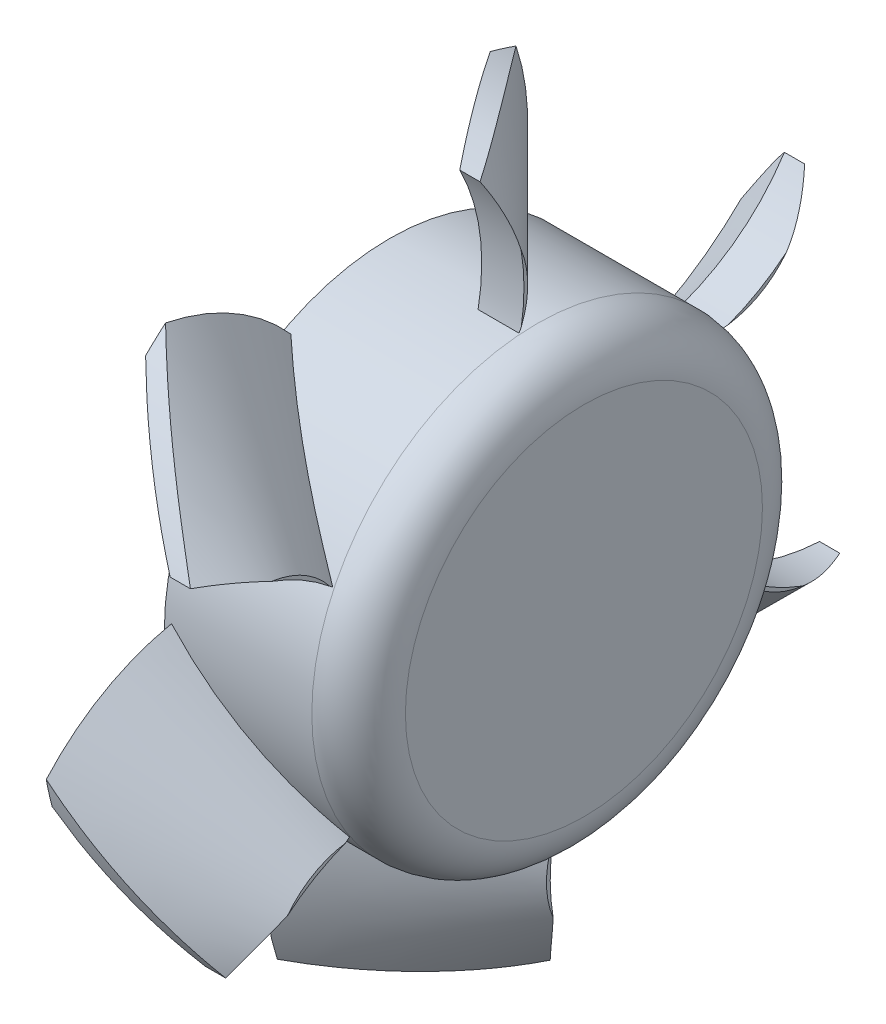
ISO-10303-21;
HEADER;
FILE_DESCRIPTION(('STEP AP214'),'2;1');
FILE_NAME('part.step','',(''),(''),'','','');
FILE_SCHEMA(('AUTOMOTIVE_DESIGN { 1 0 10303 214 1 1 1 1 }'));
ENDSEC;
DATA;
#1=APPLICATION_CONTEXT('core data for automotive mechanical design processes');
#2=APPLICATION_PROTOCOL_DEFINITION('international standard','automotive_design',2000,#1);
#3=PRODUCT_CONTEXT('',#1,'mechanical');
#4=PRODUCT('Part','Part','',(#3));
#5=PRODUCT_RELATED_PRODUCT_CATEGORY('part','',(#4));
#6=PRODUCT_DEFINITION_FORMATION('','',#4);
#7=PRODUCT_DEFINITION_CONTEXT('part definition',#1,'design');
#8=PRODUCT_DEFINITION('design','',#6,#7);
#9=PRODUCT_DEFINITION_SHAPE('','',#8);
#10=(LENGTH_UNIT() NAMED_UNIT(*) SI_UNIT(.MILLI.,.METRE.));
#11=(NAMED_UNIT(*) PLANE_ANGLE_UNIT() SI_UNIT($,.RADIAN.));
#12=(NAMED_UNIT(*) SI_UNIT($,.STERADIAN.) SOLID_ANGLE_UNIT());
#13=UNCERTAINTY_MEASURE_WITH_UNIT(LENGTH_MEASURE(1.E-05),#10,'distance_accuracy_value','');
#14=(GEOMETRIC_REPRESENTATION_CONTEXT(3) GLOBAL_UNCERTAINTY_ASSIGNED_CONTEXT((#13)) GLOBAL_UNIT_ASSIGNED_CONTEXT((#10,
#11,#12)) REPRESENTATION_CONTEXT('',''));
#15=CARTESIAN_POINT('',(0.,0.,0.));
#16=DIRECTION('',(0.,0.,1.));
#17=DIRECTION('',(1.,0.,0.));
#18=AXIS2_PLACEMENT_3D('',#15,#16,#17);
#19=CARTESIAN_POINT('',(10.541,0.,0.));
#20=DIRECTION('',(-1.,0.,0.));
#21=DIRECTION('',(0.,0.,1.));
#22=AXIS2_PLACEMENT_3D('',#19,#20,#21);
#23=CYLINDRICAL_SURFACE('',#22,12.2301);
#24=DIRECTION('',(1.,0.,0.));
#25=VECTOR('',#24,1.);
#26=CARTESIAN_POINT('',(0.379285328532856,5.30905416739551,11.017680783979));
#27=LINE('',#26,#25);
#28=CARTESIAN_POINT('',(5.70756798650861,5.30905416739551,11.017680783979));
#29=VERTEX_POINT('',#28);
#30=CARTESIAN_POINT('',(7.92782424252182,5.30905416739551,11.017680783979));
#31=VERTEX_POINT('',#30);
#32=EDGE_CURVE('E307',#29,#31,#27,.T.);
#33=ORIENTED_EDGE('',*,*,#32,.F.);
#34=CARTESIAN_POINT('',(5.70756798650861,5.30905416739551,11.017680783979));
#35=CARTESIAN_POINT('',(5.54100909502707,5.49432903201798,10.9283932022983));
#36=CARTESIAN_POINT('',(5.37359809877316,5.67672636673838,10.8347526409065));
#37=CARTESIAN_POINT('',(5.03752065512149,6.03569595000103,10.6389649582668));
#38=CARTESIAN_POINT('',(4.86885424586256,6.21226837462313,10.5368180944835));
#39=CARTESIAN_POINT('',(4.53063219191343,6.55960369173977,10.3241662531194));
#40=CARTESIAN_POINT('',(4.36107619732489,6.73036406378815,10.2136577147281));
#41=CARTESIAN_POINT('',(4.02149760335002,7.06584108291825,9.98451318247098));
#42=CARTESIAN_POINT('',(3.85147500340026,7.23055772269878,9.86587717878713));
#43=CARTESIAN_POINT('',(3.34632561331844,7.71046585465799,9.50177322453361));
#44=CARTESIAN_POINT('',(3.01090698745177,8.01675413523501,9.2448307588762));
#45=CARTESIAN_POINT('',(2.34137890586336,8.60328158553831,8.70163955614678));
#46=CARTESIAN_POINT('',(2.0072688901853,8.88353341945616,8.41540521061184));
#47=CARTESIAN_POINT('',(1.56619307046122,9.23636231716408,8.01760720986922));
#48=CARTESIAN_POINT('',(1.45797944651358,9.32154774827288,7.9184103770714));
#49=CARTESIAN_POINT('',(1.24188932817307,9.48884810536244,7.71713860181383));
#50=CARTESIAN_POINT('',(1.13401278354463,9.57096351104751,7.61506411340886));
#51=CARTESIAN_POINT('',(0.809849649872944,9.81340522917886,7.30355434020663));
#52=CARTESIAN_POINT('',(0.594114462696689,9.96895808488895,7.08981145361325));
#53=CARTESIAN_POINT('',(0.379285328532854,10.1178267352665,6.87058426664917));
#54=B_SPLINE_CURVE_WITH_KNOTS('',3,(#34,#35,#36,#37,#38,#39,#40,#41,#42,#43,#44,#45,#46,#47,#48,
#49,#50,#51,#52,#53),.UNSPECIFIED.,.F.,.F.,(4,2,2,2,2,2,2,2,2,4),(0.,0.793889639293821,
1.58775525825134,2.38196086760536,3.17616743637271,4.74019939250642,6.30346657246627,
6.81260718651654,7.32166790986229,8.34488314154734),.UNSPECIFIED.);
#55=CARTESIAN_POINT('',(0.379285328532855,10.1178267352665,6.87058426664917));
#56=VERTEX_POINT('',#55);
#57=EDGE_CURVE('E11',#29,#56,#54,.T.);
#58=ORIENTED_EDGE('',*,*,#57,.T.);
#59=CARTESIAN_POINT('',(0.379285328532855,0.,0.));
#60=DIRECTION('',(-1.,0.,0.));
#61=DIRECTION('',(0.,0.,1.));
#62=AXIS2_PLACEMENT_3D('',#59,#60,#61);
#63=CIRCLE('',#62,12.2301);
#64=CARTESIAN_POINT('',(0.379285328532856,10.7963415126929,5.74581203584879));
#65=VERTEX_POINT('',#64);
#66=EDGE_CURVE('E340',#56,#65,#63,.T.);
#67=ORIENTED_EDGE('',*,*,#66,.T.);
#68=CARTESIAN_POINT('',(0.379285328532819,10.7963415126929,5.74581203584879));
#69=CARTESIAN_POINT('',(0.596249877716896,10.6914680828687,5.94286629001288));
#70=CARTESIAN_POINT('',(0.813783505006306,10.5814671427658,6.13655140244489));
#71=CARTESIAN_POINT('',(1.24979758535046,10.351586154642,6.51685381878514));
#72=CARTESIAN_POINT('',(1.46827801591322,10.2317063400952,6.70347128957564));
#73=CARTESIAN_POINT('',(1.90607076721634,9.9824008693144,7.06937350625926));
#74=CARTESIAN_POINT('',(2.12538331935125,9.85297233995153,7.24865601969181));
#75=CARTESIAN_POINT('',(2.56453602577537,9.58495604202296,7.59951976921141));
#76=CARTESIAN_POINT('',(2.78437617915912,9.44636828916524,7.77110101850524));
#77=CARTESIAN_POINT('',(3.43667558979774,9.02233742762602,8.26802300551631));
#78=CARTESIAN_POINT('',(3.86968063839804,8.72418456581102,8.58203549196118));
#79=CARTESIAN_POINT('',(4.51808738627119,8.2527695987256,9.02850883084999));
#80=CARTESIAN_POINT('',(4.73402639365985,8.09161087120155,9.17323431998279));
#81=CARTESIAN_POINT('',(5.16516052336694,7.76125436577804,9.45438087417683));
#82=CARTESIAN_POINT('',(5.38035570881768,7.59205728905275,9.59080266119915));
#83=CARTESIAN_POINT('',(5.79314797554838,7.25869706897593,9.84516274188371));
#84=CARTESIAN_POINT('',(5.99084266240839,7.09512435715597,9.96371826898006));
#85=CARTESIAN_POINT('',(6.3843953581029,6.76087114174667,10.1934832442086));
#86=CARTESIAN_POINT('',(6.58025386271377,6.59019262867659,10.3046947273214));
#87=CARTESIAN_POINT('',(6.87275107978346,6.32772939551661,10.4664155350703));
#88=CARTESIAN_POINT('',(6.97043236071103,6.23878980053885,10.5196805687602));
#89=CARTESIAN_POINT('',(7.16490680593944,6.05885918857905,10.6243307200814));
#90=CARTESIAN_POINT('',(7.26169999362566,5.96786822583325,10.6757158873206));
#91=CARTESIAN_POINT('',(7.45422886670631,5.78365605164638,10.7766280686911));
#92=CARTESIAN_POINT('',(7.54996403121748,5.69043380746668,10.8261541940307));
#93=CARTESIAN_POINT('',(7.74002830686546,5.50159125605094,10.9233276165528));
#94=CARTESIAN_POINT('',(7.83435730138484,5.40597075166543,10.9709747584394));
#95=CARTESIAN_POINT('',(7.92782424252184,5.30905416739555,11.017680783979));
#96=B_SPLINE_CURVE_WITH_KNOTS('',3,(#68,#69,#70,#71,#72,#73,#74,#75,#76,#77,#78,#79,#80,#81,#82,
#83,#84,#85,#86,#87,#88,#89,#90,#91,#92,#93,#94,#95),.UNSPECIFIED.,.F.,.F.,(4,2,2,2,2,2,2,2,2,2,
2,2,2,4),(0.,0.933799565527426,1.86757706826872,2.80163669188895,3.73569471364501,
5.5707258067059,6.4881297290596,7.40545377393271,8.25325096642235,9.10081224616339,
9.52810688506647,9.95539023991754,10.382875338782,10.8103956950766),.UNSPECIFIED.);
#97=EDGE_CURVE('E414',#65,#31,#96,.T.);
#98=ORIENTED_EDGE('',*,*,#97,.T.);
#99=EDGE_LOOP('',(#33,#58,#67,#98));
#100=FACE_BOUND('',#99,.T.);
#101=DIRECTION('',(1.,0.,0.));
#102=VECTOR('',#101,1.);
#103=CARTESIAN_POINT('',(0.379285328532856,12.1961185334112,0.911064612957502));
#104=LINE('',#103,#102);
#105=CARTESIAN_POINT('',(5.7075679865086,12.1961185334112,0.911064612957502));
#106=VERTEX_POINT('',#105);
#107=CARTESIAN_POINT('',(7.9278242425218,12.1961185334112,0.911064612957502));
#108=VERTEX_POINT('',#107);
#109=EDGE_CURVE('E326',#106,#108,#104,.T.);
#110=ORIENTED_EDGE('',*,*,#109,.F.);
#111=CARTESIAN_POINT('',(5.70756798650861,12.1961185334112,0.911064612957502));
#112=CARTESIAN_POINT('',(5.54100909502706,12.2114306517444,0.705968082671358));
#113=CARTESIAN_POINT('',(5.37359809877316,12.2215342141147,0.501187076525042));
#114=CARTESIAN_POINT('',(5.0375206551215,12.231461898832,0.0924164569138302));
#115=CARTESIAN_POINT('',(4.86885424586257,12.2312863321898,-0.111573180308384));
#116=CARTESIAN_POINT('',(4.53063219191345,12.2207920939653,-0.518700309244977));
#117=CARTESIAN_POINT('',(4.36107619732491,12.2104690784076,-0.721837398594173));
#118=CARTESIAN_POINT('',(4.02149760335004,12.1797626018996,-1.12694128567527));
#119=CARTESIAN_POINT('',(3.85147500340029,12.1593791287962,-1.32890808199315));
#120=CARTESIAN_POINT('',(3.34632561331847,12.0840099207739,-1.92657269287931));
#121=CARTESIAN_POINT('',(3.01090698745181,12.0146353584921,-2.32029735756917));
#122=CARTESIAN_POINT('',(2.34137890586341,11.8374817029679,-3.09984063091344));
#123=CARTESIAN_POINT('',(2.00726889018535,11.7297214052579,-3.48566301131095));
#124=CARTESIAN_POINT('',(1.56619307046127,11.5616326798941,-3.99012080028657));
#125=CARTESIAN_POINT('',(1.45797944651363,11.5183184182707,-4.11349196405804));
#126=CARTESIAN_POINT('',(1.2418893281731,11.4276621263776,-4.3590142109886));
#127=CARTESIAN_POINT('',(1.13401278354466,11.3803207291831,-4.48116548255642));
#128=CARTESIAN_POINT('',(0.809849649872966,11.2317662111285,-4.84688105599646));
#129=CARTESIAN_POINT('',(0.594114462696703,11.1244358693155,-5.08846522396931));
#130=CARTESIAN_POINT('',(0.379285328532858,11.0090138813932,-5.3270028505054));
#131=B_SPLINE_CURVE_WITH_KNOTS('',3,(#111,#112,#113,#114,#115,#116,#117,#118,#119,#120,#121,
#122,#123,#124,#125,#126,#127,#128,#129,#130),.UNSPECIFIED.,.F.,.F.,(4,2,2,2,2,2,2,2,2,4),(0.,
0.793889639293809,1.58775525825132,2.38196086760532,3.17616743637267,4.74019939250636,
6.30346657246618,6.81260718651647,7.32166790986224,8.34488314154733),.UNSPECIFIED.);
#132=CARTESIAN_POINT('',(0.379285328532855,11.0090138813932,-5.3270028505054));
#133=VERTEX_POINT('',#132);
#134=EDGE_CURVE('E392',#106,#133,#131,.T.);
#135=ORIENTED_EDGE('',*,*,#134,.T.);
#136=CARTESIAN_POINT('',(0.379285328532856,10.3741899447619,-6.477));
#137=VERTEX_POINT('',#136);
#138=EDGE_CURVE('E341',#133,#137,#63,.T.);
#139=ORIENTED_EDGE('',*,*,#138,.T.);
#140=CARTESIAN_POINT('',(0.379285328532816,10.3741899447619,-6.477));
#141=CARTESIAN_POINT('',(0.596249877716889,10.4924072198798,-6.28764981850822));
#142=CARTESIAN_POINT('',(0.813783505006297,10.6051429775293,-6.09554365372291));
#143=CARTESIAN_POINT('',(1.24979758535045,10.8195540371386,-5.70630966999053));
#144=CARTESIAN_POINT('',(1.4682780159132,10.9212296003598,-5.5091819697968));
#145=CARTESIAN_POINT('',(1.90607076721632,11.1134574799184,-5.11032599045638));
#146=CARTESIAN_POINT('',(2.12538331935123,11.2040064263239,-4.90859633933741));
#147=CARTESIAN_POINT('',(2.56453602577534,11.3738551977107,-4.5010555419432));
#148=CARTESIAN_POINT('',(2.78437617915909,11.4531550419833,-4.29524440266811));
#149=CARTESIAN_POINT('',(3.4366755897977,11.6714866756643,-3.679561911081));
#150=CARTESIAN_POINT('',(3.869680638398,11.7943530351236,-3.26434771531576));
#151=CARTESIAN_POINT('',(4.51808738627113,11.9453028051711,-2.63285370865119));
#152=CARTESIAN_POINT('',(4.73402639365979,11.9900593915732,-2.42092341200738));
#153=CARTESIAN_POINT('',(5.16516052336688,12.0683611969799,-1.99425300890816));
#154=CARTESIAN_POINT('',(5.38035570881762,12.1019073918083,-1.77951314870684));
#155=CARTESIAN_POINT('',(5.79314797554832,12.1555095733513,-1.36363468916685));
#156=CARTESIAN_POINT('',(5.99084266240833,12.1763953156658,-1.16269880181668));
#157=CARTESIAN_POINT('',(6.38439535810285,12.208251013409,-0.758344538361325));
#158=CARTESIAN_POINT('',(6.58025386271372,12.2192237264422,-0.554926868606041));
#159=CARTESIAN_POINT('',(6.87275107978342,12.2280464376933,-0.246766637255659));
#160=CARTESIAN_POINT('',(6.97043236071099,12.2297055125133,-0.143110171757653));
#161=CARTESIAN_POINT('',(7.16490680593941,12.2303698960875,0.065039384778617));
#162=CARTESIAN_POINT('',(7.26169999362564,12.2293752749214,0.169532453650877));
#163=CARTESIAN_POINT('',(7.45422886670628,12.2246617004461,0.379520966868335));
#164=CARTESIAN_POINT('',(7.54996403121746,12.2209414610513,0.485016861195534));
#165=CARTESIAN_POINT('',(7.74002830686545,12.2106748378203,0.697146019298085));
#166=CARTESIAN_POINT('',(7.83435730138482,12.2041282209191,0.803779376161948));
#167=CARTESIAN_POINT('',(7.92782424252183,12.1961185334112,0.911064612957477));
#168=B_SPLINE_CURVE_WITH_KNOTS('',3,(#140,#141,#142,#143,#144,#145,#146,#147,#148,#149,#150,
#151,#152,#153,#154,#155,#156,#157,#158,#159,#160,#161,#162,#163,#164,#165,#166,#167),
.UNSPECIFIED.,.F.,.F.,(4,2,2,2,2,2,2,2,2,2,2,2,2,4),(0.,0.933799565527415,1.8675770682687,
2.80163669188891,3.73569471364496,5.57072580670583,6.48812972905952,7.40545377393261,
8.25325096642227,9.10081224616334,9.52810688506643,9.95539023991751,10.382875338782,
10.8103956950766),.UNSPECIFIED.);
#169=EDGE_CURVE('E242',#137,#108,#168,.T.);
#170=ORIENTED_EDGE('',*,*,#169,.T.);
#171=EDGE_LOOP('',(#110,#135,#139,#170));
#172=FACE_BOUND('',#171,.T.);
#173=DIRECTION('',(1.,0.,0.));
#174=VECTOR('',#173,1.);
#175=CARTESIAN_POINT('',(0.379285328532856,6.88706436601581,-10.1066161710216));
#176=LINE('',#175,#174);
#177=CARTESIAN_POINT('',(5.7075679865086,6.88706436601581,-10.1066161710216));
#178=VERTEX_POINT('',#177);
#179=CARTESIAN_POINT('',(7.9278242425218,6.88706436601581,-10.1066161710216));
#180=VERTEX_POINT('',#179);
#181=EDGE_CURVE('E323',#178,#180,#176,.T.);
#182=ORIENTED_EDGE('',*,*,#181,.F.);
#183=CARTESIAN_POINT('',(5.7075679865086,6.88706436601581,-10.1066161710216));
#184=CARTESIAN_POINT('',(5.54100909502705,6.71710161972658,-10.222425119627));
#185=CARTESIAN_POINT('',(5.37359809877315,6.54480784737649,-10.3335655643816));
#186=CARTESIAN_POINT('',(5.03752065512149,6.1957659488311,-10.5465485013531));
#187=CARTESIAN_POINT('',(4.86885424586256,6.01901795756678,-10.648391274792));
#188=CARTESIAN_POINT('',(4.53063219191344,5.6611884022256,-10.8428665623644));
#189=CARTESIAN_POINT('',(4.3610761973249,5.48010501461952,-10.9354951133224));
#190=CARTESIAN_POINT('',(4.02149760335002,5.11392151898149,-11.1114544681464));
#191=CARTESIAN_POINT('',(3.85147500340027,4.92882140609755,-11.1947852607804));
#192=CARTESIAN_POINT('',(3.34632561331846,4.37354406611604,-11.4283459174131));
#193=CARTESIAN_POINT('',(3.01090698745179,3.9978812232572,-11.5651281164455));
#194=CARTESIAN_POINT('',(2.34137890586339,3.23420011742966,-11.8014801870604));
#195=CARTESIAN_POINT('',(2.00726889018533,2.84618798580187,-11.901068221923));
#196=CARTESIAN_POINT('',(1.56619307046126,2.32527036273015,-12.007728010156));
#197=CARTESIAN_POINT('',(1.45797944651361,2.19677066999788,-12.0319023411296));
#198=CARTESIAN_POINT('',(1.24188932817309,1.93881402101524,-12.0761528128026));
#199=CARTESIAN_POINT('',(1.13401278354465,1.80935721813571,-12.0962295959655));
#200=CARTESIAN_POINT('',(0.809849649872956,1.41836098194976,-12.1504353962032));
#201=CARTESIAN_POINT('',(0.594114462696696,1.15547778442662,-12.1782766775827));
#202=CARTESIAN_POINT('',(0.379285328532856,0.891187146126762,-12.1975871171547));
#203=B_SPLINE_CURVE_WITH_KNOTS('',3,(#183,#184,#185,#186,#187,#188,#189,#190,#191,#192,#193,
#194,#195,#196,#197,#198,#199,#200,#201,#202),.UNSPECIFIED.,.F.,.F.,(4,2,2,2,2,2,2,2,2,4),(0.,
0.793889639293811,1.58775525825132,2.38196086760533,3.17616743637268,4.74019939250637,
6.3034665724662,6.81260718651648,7.32166790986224,8.34488314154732),.UNSPECIFIED.);
#204=CARTESIAN_POINT('',(0.379285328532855,0.891187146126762,-12.1975871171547));
#205=VERTEX_POINT('',#204);
#206=EDGE_CURVE('E458',#178,#205,#203,.T.);
#207=ORIENTED_EDGE('',*,*,#206,.T.);
#208=CARTESIAN_POINT('',(0.379285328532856,-0.422151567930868,-12.2228120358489));
#209=VERTEX_POINT('',#208);
#210=EDGE_CURVE('E632',#205,#209,#63,.T.);
#211=ORIENTED_EDGE('',*,*,#210,.T.);
#212=CARTESIAN_POINT('',(0.379285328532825,-0.422151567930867,-12.2228120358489));
#213=CARTESIAN_POINT('',(0.596249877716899,-0.199060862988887,-12.2305161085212));
#214=CARTESIAN_POINT('',(0.813783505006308,0.0236758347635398,-12.2320950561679));
#215=CARTESIAN_POINT('',(1.24979758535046,0.467967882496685,-12.2231634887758));
#216=CARTESIAN_POINT('',(1.46827801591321,0.689523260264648,-12.2126532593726));
#217=CARTESIAN_POINT('',(1.90607076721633,1.1310566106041,-12.1796994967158));
#218=CARTESIAN_POINT('',(2.12538331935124,1.35103408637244,-12.1572523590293));
#219=CARTESIAN_POINT('',(2.56453602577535,1.78889915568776,-12.1005753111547));
#220=CARTESIAN_POINT('',(2.7843761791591,2.00678675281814,-12.0663454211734));
#221=CARTESIAN_POINT('',(3.43667558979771,2.64914924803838,-11.9475849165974));
#222=CARTESIAN_POINT('',(3.86968063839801,3.07016846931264,-11.846383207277));
#223=CARTESIAN_POINT('',(4.51808738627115,3.69253320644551,-11.6613625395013));
#224=CARTESIAN_POINT('',(4.73402639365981,3.89844852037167,-11.5941577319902));
#225=CARTESIAN_POINT('',(5.16516052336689,4.30710683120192,-11.4486338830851));
#226=CARTESIAN_POINT('',(5.38035570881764,4.50985010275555,-11.3703158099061));
#227=CARTESIAN_POINT('',(5.79314797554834,4.89681250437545,-11.2087974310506));
#228=CARTESIAN_POINT('',(5.99084266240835,5.08127095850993,-11.1264170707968));
#229=CARTESIAN_POINT('',(6.38439535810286,5.44737987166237,-10.95182778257));
#230=CARTESIAN_POINT('',(6.58025386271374,5.62903109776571,-10.8596215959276));
#231=CARTESIAN_POINT('',(6.87275107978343,5.90031704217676,-10.713182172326));
#232=CARTESIAN_POINT('',(6.970432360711,5.99091571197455,-10.662790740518));
#233=CARTESIAN_POINT('',(7.16490680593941,6.17151070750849,-10.5592913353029));
#234=CARTESIAN_POINT('',(7.26169999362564,6.26150704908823,-10.5061834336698));
#235=CARTESIAN_POINT('',(7.45422886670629,6.44100564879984,-10.3971071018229));
#236=CARTESIAN_POINT('',(7.54996403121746,6.53050765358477,-10.3411373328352));
#237=CARTESIAN_POINT('',(7.74002830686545,6.70908358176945,-10.2261815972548));
#238=CARTESIAN_POINT('',(7.83435730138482,6.79815746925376,-10.1671953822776));
#239=CARTESIAN_POINT('',(7.92782424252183,6.88706436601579,-10.1066161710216));
#240=B_SPLINE_CURVE_WITH_KNOTS('',3,(#212,#213,#214,#215,#216,#217,#218,#219,#220,#221,#222,
#223,#224,#225,#226,#227,#228,#229,#230,#231,#232,#233,#234,#235,#236,#237,#238,#239),
.UNSPECIFIED.,.F.,.F.,(4,2,2,2,2,2,2,2,2,2,2,2,2,4),(0.,0.933799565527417,1.8675770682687,
2.80163669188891,3.73569471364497,5.57072580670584,6.48812972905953,7.40545377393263,
8.25325096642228,9.10081224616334,9.52810688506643,9.9553902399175,10.382875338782,
10.8103956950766),.UNSPECIFIED.);
#241=EDGE_CURVE('E449',#209,#180,#240,.T.);
#242=ORIENTED_EDGE('',*,*,#241,.T.);
#243=EDGE_LOOP('',(#182,#207,#211,#242));
#244=FACE_BOUND('',#243,.T.);
#245=DIRECTION('',(1.,0.,0.));
#246=VECTOR('',#245,1.);
#247=CARTESIAN_POINT('',(0.379285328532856,-5.30905416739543,-11.017680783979));
#248=LINE('',#247,#246);
#249=CARTESIAN_POINT('',(5.70756798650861,-5.30905416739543,-11.017680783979));
#250=VERTEX_POINT('',#249);
#251=CARTESIAN_POINT('',(7.92782424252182,-5.30905416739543,-11.017680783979));
#252=VERTEX_POINT('',#251);
#253=EDGE_CURVE('E319',#250,#252,#248,.T.);
#254=ORIENTED_EDGE('',*,*,#253,.F.);
#255=CARTESIAN_POINT('',(5.70756798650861,-5.30905416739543,-11.017680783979));
#256=CARTESIAN_POINT('',(5.54100909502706,-5.49432903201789,-10.9283932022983));
#257=CARTESIAN_POINT('',(5.37359809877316,-5.67672636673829,-10.8347526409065));
#258=CARTESIAN_POINT('',(5.0375206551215,-6.03569595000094,-10.6389649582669));
#259=CARTESIAN_POINT('',(4.86885424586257,-6.21226837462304,-10.5368180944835));
#260=CARTESIAN_POINT('',(4.53063219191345,-6.55960369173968,-10.3241662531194));
#261=CARTESIAN_POINT('',(4.3610761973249,-6.73036406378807,-10.2136577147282));
#262=CARTESIAN_POINT('',(4.02149760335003,-7.06584108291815,-9.98451318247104));
#263=CARTESIAN_POINT('',(3.85147500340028,-7.23055772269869,-9.8658771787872));
#264=CARTESIAN_POINT('',(3.34632561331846,-7.7104658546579,-9.50177322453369));
#265=CARTESIAN_POINT('',(3.0109069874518,-8.01675413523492,-9.24483075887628));
#266=CARTESIAN_POINT('',(2.34137890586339,-8.60328158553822,-8.70163955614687));
#267=CARTESIAN_POINT('',(2.00726889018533,-8.88353341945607,-8.41540521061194));
#268=CARTESIAN_POINT('',(1.56619307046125,-9.23636231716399,-8.01760720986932));
#269=CARTESIAN_POINT('',(1.45797944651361,-9.3215477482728,-7.9184103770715));
#270=CARTESIAN_POINT('',(1.24188932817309,-9.48884810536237,-7.71713860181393));
#271=CARTESIAN_POINT('',(1.13401278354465,-9.57096351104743,-7.61506411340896));
#272=CARTESIAN_POINT('',(0.809849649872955,-9.81340522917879,-7.30355434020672));
#273=CARTESIAN_POINT('',(0.594114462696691,-9.96895808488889,-7.08981145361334));
#274=CARTESIAN_POINT('',(0.379285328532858,-10.1178267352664,-6.87058426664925));
#275=B_SPLINE_CURVE_WITH_KNOTS('',3,(#255,#256,#257,#258,#259,#260,#261,#262,#263,#264,#265,
#266,#267,#268,#269,#270,#271,#272,#273,#274),.UNSPECIFIED.,.F.,.F.,(4,2,2,2,2,2,2,2,2,4),(0.,
0.793889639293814,1.58775525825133,2.38196086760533,3.17616743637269,4.74019939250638,
6.30346657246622,6.81260718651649,7.32166790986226,8.34488314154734),.UNSPECIFIED.);
#276=CARTESIAN_POINT('',(0.379285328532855,-10.1178267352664,-6.87058426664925));
#277=VERTEX_POINT('',#276);
#278=EDGE_CURVE('E467',#250,#277,#275,.T.);
#279=ORIENTED_EDGE('',*,*,#278,.T.);
#280=CARTESIAN_POINT('',(0.379285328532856,-10.7963415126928,-5.74581203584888));
#281=VERTEX_POINT('',#280);
#282=EDGE_CURVE('E633',#277,#281,#63,.T.);
#283=ORIENTED_EDGE('',*,*,#282,.T.);
#284=CARTESIAN_POINT('',(0.379285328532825,-10.7963415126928,-5.74581203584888));
#285=CARTESIAN_POINT('',(0.596249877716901,-10.6914680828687,-5.94286629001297));
#286=CARTESIAN_POINT('',(0.813783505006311,-10.5814671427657,-6.13655140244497));
#287=CARTESIAN_POINT('',(1.24979758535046,-10.3515861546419,-6.51685381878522));
#288=CARTESIAN_POINT('',(1.46827801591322,-10.2317063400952,-6.70347128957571));
#289=CARTESIAN_POINT('',(1.90607076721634,-9.98240086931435,-7.06937350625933));
#290=CARTESIAN_POINT('',(2.12538331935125,-9.85297233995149,-7.24865601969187));
#291=CARTESIAN_POINT('',(2.56453602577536,-9.58495604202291,-7.59951976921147));
#292=CARTESIAN_POINT('',(2.78437617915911,-9.44636828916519,-7.77110101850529));
#293=CARTESIAN_POINT('',(3.43667558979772,-9.02233742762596,-8.26802300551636));
#294=CARTESIAN_POINT('',(3.86968063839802,-8.72418456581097,-8.58203549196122));
#295=CARTESIAN_POINT('',(4.51808738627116,-8.25276959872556,-9.02850883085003));
#296=CARTESIAN_POINT('',(4.73402639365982,-8.09161087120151,-9.17323431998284));
#297=CARTESIAN_POINT('',(5.16516052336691,-7.761254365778,-9.45438087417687));
#298=CARTESIAN_POINT('',(5.38035570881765,-7.59205728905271,-9.59080266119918));
#299=CARTESIAN_POINT('',(5.79314797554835,-7.25869706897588,-9.84516274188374));
#300=CARTESIAN_POINT('',(5.99084266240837,-7.09512435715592,-9.96371826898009));
#301=CARTESIAN_POINT('',(6.38439535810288,-6.76087114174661,-10.1934832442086));
#302=CARTESIAN_POINT('',(6.58025386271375,-6.59019262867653,-10.3046947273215));
#303=CARTESIAN_POINT('',(6.87275107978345,-6.32772939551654,-10.4664155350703));
#304=CARTESIAN_POINT('',(6.97043236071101,-6.23878980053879,-10.5196805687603));
#305=CARTESIAN_POINT('',(7.16490680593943,-6.05885918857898,-10.6243307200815));
#306=CARTESIAN_POINT('',(7.26169999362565,-5.96786822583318,-10.6757158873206));
#307=CARTESIAN_POINT('',(7.45422886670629,-5.7836560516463,-10.7766280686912));
#308=CARTESIAN_POINT('',(7.54996403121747,-5.6904338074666,-10.8261541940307));
#309=CARTESIAN_POINT('',(7.74002830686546,-5.50159125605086,-10.9233276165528));
#310=CARTESIAN_POINT('',(7.83435730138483,-5.40597075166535,-10.9709747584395));
#311=CARTESIAN_POINT('',(7.92782424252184,-5.30905416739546,-11.017680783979));
#312=B_SPLINE_CURVE_WITH_KNOTS('',3,(#284,#285,#286,#287,#288,#289,#290,#291,#292,#293,#294,
#295,#296,#297,#298,#299,#300,#301,#302,#303,#304,#305,#306,#307,#308,#309,#310,#311),
.UNSPECIFIED.,.F.,.F.,(4,2,2,2,2,2,2,2,2,2,2,2,2,4),(0.,0.933799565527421,1.86757706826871,
2.80163669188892,3.73569471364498,5.57072580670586,6.48812972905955,7.40545377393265,
8.2532509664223,9.10081224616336,9.52810688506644,9.95539023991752,10.382875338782,
10.8103956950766),.UNSPECIFIED.);
#313=EDGE_CURVE('E440',#281,#252,#312,.T.);
#314=ORIENTED_EDGE('',*,*,#313,.T.);
#315=EDGE_LOOP('',(#254,#279,#283,#314));
#316=FACE_BOUND('',#315,.T.);
#317=DIRECTION('',(1.,0.,0.));
#318=VECTOR('',#317,1.);
#319=CARTESIAN_POINT('',(0.379285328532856,-12.1961185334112,-0.911064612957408));
#320=LINE('',#319,#318);
#321=CARTESIAN_POINT('',(5.7075679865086,-12.1961185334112,-0.911064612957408));
#322=VERTEX_POINT('',#321);
#323=CARTESIAN_POINT('',(7.92782424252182,-12.1961185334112,-0.911064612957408));
#324=VERTEX_POINT('',#323);
#325=EDGE_CURVE('E315',#322,#324,#320,.T.);
#326=ORIENTED_EDGE('',*,*,#325,.F.);
#327=CARTESIAN_POINT('',(5.7075679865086,-12.1961185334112,-0.911064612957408));
#328=CARTESIAN_POINT('',(5.54100909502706,-12.2114306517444,-0.705968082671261));
#329=CARTESIAN_POINT('',(5.37359809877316,-12.2215342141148,-0.501187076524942));
#330=CARTESIAN_POINT('',(5.03752065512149,-12.231461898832,-0.0924164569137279));
#331=CARTESIAN_POINT('',(4.86885424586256,-12.2312863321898,0.111573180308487));
#332=CARTESIAN_POINT('',(4.53063219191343,-12.2207920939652,0.518700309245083));
#333=CARTESIAN_POINT('',(4.36107619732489,-12.2104690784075,0.721837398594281));
#334=CARTESIAN_POINT('',(4.02149760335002,-12.1797626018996,1.12694128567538));
#335=CARTESIAN_POINT('',(3.85147500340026,-12.1593791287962,1.32890808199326));
#336=CARTESIAN_POINT('',(3.34632561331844,-12.0840099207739,1.92657269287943));
#337=CARTESIAN_POINT('',(3.01090698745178,-12.0146353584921,2.32029735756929));
#338=CARTESIAN_POINT('',(2.34137890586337,-11.8374817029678,3.09984063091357));
#339=CARTESIAN_POINT('',(2.00726889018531,-11.7297214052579,3.48566301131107));
#340=CARTESIAN_POINT('',(1.56619307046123,-11.5616326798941,3.9901208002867));
#341=CARTESIAN_POINT('',(1.45797944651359,-11.5183184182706,4.11349196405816));
#342=CARTESIAN_POINT('',(1.24188932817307,-11.4276621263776,4.35901421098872));
#343=CARTESIAN_POINT('',(1.13401278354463,-11.3803207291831,4.48116548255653));
#344=CARTESIAN_POINT('',(0.809849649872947,-11.2317662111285,4.84688105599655));
#345=CARTESIAN_POINT('',(0.594114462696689,-11.1244358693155,5.08846522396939));
#346=CARTESIAN_POINT('',(0.379285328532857,-11.0090138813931,5.32700285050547));
#347=B_SPLINE_CURVE_WITH_KNOTS('',3,(#327,#328,#329,#330,#331,#332,#333,#334,#335,#336,#337,
#338,#339,#340,#341,#342,#343,#344,#345,#346),.UNSPECIFIED.,.F.,.F.,(4,2,2,2,2,2,2,2,2,4),(0.,
0.793889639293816,1.58775525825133,2.38196086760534,3.1761674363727,4.7401993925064,
6.30346657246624,6.81260718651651,7.32166790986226,8.34488314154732),.UNSPECIFIED.);
#348=CARTESIAN_POINT('',(0.379285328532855,-11.0090138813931,5.32700285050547));
#349=VERTEX_POINT('',#348);
#350=EDGE_CURVE('E475',#322,#349,#347,.T.);
#351=ORIENTED_EDGE('',*,*,#350,.T.);
#352=CARTESIAN_POINT('',(0.379285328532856,-10.3741899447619,6.47700000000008));
#353=VERTEX_POINT('',#352);
#354=EDGE_CURVE('E339',#349,#353,#63,.T.);
#355=ORIENTED_EDGE('',*,*,#354,.T.);
#356=CARTESIAN_POINT('',(0.379285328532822,-10.3741899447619,6.47700000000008));
#357=CARTESIAN_POINT('',(0.596249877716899,-10.4924072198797,6.28764981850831));
#358=CARTESIAN_POINT('',(0.813783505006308,-10.6051429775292,6.095543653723));
#359=CARTESIAN_POINT('',(1.24979758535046,-10.8195540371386,5.70630966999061));
#360=CARTESIAN_POINT('',(1.46827801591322,-10.9212296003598,5.50918196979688));
#361=CARTESIAN_POINT('',(1.90607076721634,-11.1134574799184,5.11032599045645));
#362=CARTESIAN_POINT('',(2.12538331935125,-11.2040064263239,4.90859633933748));
#363=CARTESIAN_POINT('',(2.56453602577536,-11.3738551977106,4.50105554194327));
#364=CARTESIAN_POINT('',(2.78437617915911,-11.4531550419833,4.29524440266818));
#365=CARTESIAN_POINT('',(3.43667558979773,-11.6714866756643,3.67956191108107));
#366=CARTESIAN_POINT('',(3.86968063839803,-11.7943530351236,3.26434771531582));
#367=CARTESIAN_POINT('',(4.51808738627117,-11.945302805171,2.63285370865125));
#368=CARTESIAN_POINT('',(4.73402639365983,-11.9900593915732,2.42092341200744));
#369=CARTESIAN_POINT('',(5.16516052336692,-12.0683611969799,1.99425300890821));
#370=CARTESIAN_POINT('',(5.38035570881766,-12.1019073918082,1.77951314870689));
#371=CARTESIAN_POINT('',(5.79314797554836,-12.1555095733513,1.36363468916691));
#372=CARTESIAN_POINT('',(5.99084266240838,-12.1763953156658,1.16269880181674));
#373=CARTESIAN_POINT('',(6.38439535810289,-12.208251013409,0.75834453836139));
#374=CARTESIAN_POINT('',(6.58025386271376,-12.2192237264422,0.55492686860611));
#375=CARTESIAN_POINT('',(6.87275107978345,-12.2280464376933,0.246766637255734));
#376=CARTESIAN_POINT('',(6.97043236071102,-12.2297055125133,0.143110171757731));
#377=CARTESIAN_POINT('',(7.16490680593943,-12.2303698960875,-0.0650393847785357));
#378=CARTESIAN_POINT('',(7.26169999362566,-12.2293752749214,-0.169532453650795));
#379=CARTESIAN_POINT('',(7.4542288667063,-12.2246617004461,-0.379520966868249));
#380=CARTESIAN_POINT('',(7.54996403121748,-12.2209414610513,-0.485016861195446));
#381=CARTESIAN_POINT('',(7.74002830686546,-12.2106748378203,-0.697146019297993));
#382=CARTESIAN_POINT('',(7.83435730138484,-12.2041282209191,-0.803779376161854));
#383=CARTESIAN_POINT('',(7.92782424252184,-12.1961185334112,-0.911064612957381));
#384=B_SPLINE_CURVE_WITH_KNOTS('',3,(#356,#357,#358,#359,#360,#361,#362,#363,#364,#365,#366,
#367,#368,#369,#370,#371,#372,#373,#374,#375,#376,#377,#378,#379,#380,#381,#382,#383),
.UNSPECIFIED.,.F.,.F.,(4,2,2,2,2,2,2,2,2,2,2,2,2,4),(0.,0.933799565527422,1.86757706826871,
2.80163669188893,3.73569471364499,5.57072580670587,6.48812972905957,7.40545377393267,
8.25325096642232,9.10081224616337,9.52810688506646,9.95539023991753,10.382875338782,
10.8103956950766),.UNSPECIFIED.);
#385=EDGE_CURVE('E431',#353,#324,#384,.T.);
#386=ORIENTED_EDGE('',*,*,#385,.T.);
#387=EDGE_LOOP('',(#326,#351,#355,#386));
#388=FACE_BOUND('',#387,.T.);
#389=DIRECTION('',(1.,0.,0.));
#390=VECTOR('',#389,1.);
#391=CARTESIAN_POINT('',(0.379285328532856,-6.88706436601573,10.1066161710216));
#392=LINE('',#391,#390);
#393=CARTESIAN_POINT('',(5.70756798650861,-6.88706436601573,10.1066161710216));
#394=VERTEX_POINT('',#393);
#395=CARTESIAN_POINT('',(7.92782424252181,-6.88706436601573,10.1066161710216));
#396=VERTEX_POINT('',#395);
#397=EDGE_CURVE('E311',#394,#396,#392,.T.);
#398=ORIENTED_EDGE('',*,*,#397,.F.);
#399=CARTESIAN_POINT('',(5.70756798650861,-6.88706436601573,10.1066161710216));
#400=CARTESIAN_POINT('',(5.54100909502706,-6.7171016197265,10.222425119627));
#401=CARTESIAN_POINT('',(5.37359809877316,-6.54480784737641,10.3335655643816));
#402=CARTESIAN_POINT('',(5.03752065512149,-6.19576594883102,10.5465485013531));
#403=CARTESIAN_POINT('',(4.86885424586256,-6.0190179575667,10.648391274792));
#404=CARTESIAN_POINT('',(4.53063219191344,-5.66118840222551,10.8428665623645));
#405=CARTESIAN_POINT('',(4.36107619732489,-5.48010501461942,10.9354951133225));
#406=CARTESIAN_POINT('',(4.02149760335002,-5.1139215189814,11.1114544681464));
#407=CARTESIAN_POINT('',(3.85147500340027,-4.92882140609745,11.1947852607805));
#408=CARTESIAN_POINT('',(3.34632561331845,-4.37354406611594,11.4283459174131));
#409=CARTESIAN_POINT('',(3.01090698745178,-3.99788122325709,11.5651281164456));
#410=CARTESIAN_POINT('',(2.34137890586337,-3.23420011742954,11.8014801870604));
#411=CARTESIAN_POINT('',(2.00726889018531,-2.84618798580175,11.901068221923));
#412=CARTESIAN_POINT('',(1.56619307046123,-2.32527036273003,12.007728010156));
#413=CARTESIAN_POINT('',(1.45797944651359,-2.19677066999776,12.0319023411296));
#414=CARTESIAN_POINT('',(1.24188932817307,-1.93881402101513,12.0761528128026));
#415=CARTESIAN_POINT('',(1.13401278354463,-1.80935721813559,12.0962295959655));
#416=CARTESIAN_POINT('',(0.809849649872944,-1.41836098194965,12.1504353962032));
#417=CARTESIAN_POINT('',(0.594114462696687,-1.15547778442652,12.1782766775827));
#418=CARTESIAN_POINT('',(0.379285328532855,-0.891187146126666,12.1975871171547));
#419=B_SPLINE_CURVE_WITH_KNOTS('',3,(#399,#400,#401,#402,#403,#404,#405,#406,#407,#408,#409,
#410,#411,#412,#413,#414,#415,#416,#417,#418),.UNSPECIFIED.,.F.,.F.,(4,2,2,2,2,2,2,2,2,4),(0.,
0.793889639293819,1.58775525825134,2.38196086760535,3.17616743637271,4.74019939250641,
6.30346657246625,6.81260718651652,7.32166790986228,8.34488314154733),.UNSPECIFIED.);
#420=CARTESIAN_POINT('',(0.379285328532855,-0.891187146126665,12.1975871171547));
#421=VERTEX_POINT('',#420);
#422=EDGE_CURVE('E483',#394,#421,#419,.T.);
#423=ORIENTED_EDGE('',*,*,#422,.T.);
#424=CARTESIAN_POINT('',(0.379285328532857,0.422151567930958,12.2228120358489));
#425=VERTEX_POINT('',#424);
#426=EDGE_CURVE('E337',#421,#425,#63,.T.);
#427=ORIENTED_EDGE('',*,*,#426,.T.);
#428=CARTESIAN_POINT('',(0.379285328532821,0.422151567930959,12.2228120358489));
#429=CARTESIAN_POINT('',(0.596249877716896,0.199060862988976,12.2305161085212));
#430=CARTESIAN_POINT('',(0.813783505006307,-0.0236758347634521,12.2320950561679));
#431=CARTESIAN_POINT('',(1.24979758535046,-0.467967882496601,12.2231634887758));
#432=CARTESIAN_POINT('',(1.46827801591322,-0.689523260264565,12.2126532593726));
#433=CARTESIAN_POINT('',(1.90607076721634,-1.13105661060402,12.1796994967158));
#434=CARTESIAN_POINT('',(2.12538331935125,-1.35103408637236,12.1572523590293));
#435=CARTESIAN_POINT('',(2.56453602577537,-1.78889915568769,12.1005753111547));
#436=CARTESIAN_POINT('',(2.78437617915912,-2.00678675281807,12.0663454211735));
#437=CARTESIAN_POINT('',(3.43667558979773,-2.64914924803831,11.9475849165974));
#438=CARTESIAN_POINT('',(3.86968063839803,-3.07016846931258,11.846383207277));
#439=CARTESIAN_POINT('',(4.51808738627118,-3.69253320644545,11.6613625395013));
#440=CARTESIAN_POINT('',(4.73402639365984,-3.89844852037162,11.5941577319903));
#441=CARTESIAN_POINT('',(5.16516052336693,-4.30710683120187,11.4486338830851));
#442=CARTESIAN_POINT('',(5.38035570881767,-4.5098501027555,11.3703158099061));
#443=CARTESIAN_POINT('',(5.79314797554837,-4.89681250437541,11.2087974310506));
#444=CARTESIAN_POINT('',(5.99084266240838,-5.08127095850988,11.1264170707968));
#445=CARTESIAN_POINT('',(6.38439535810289,-5.44737987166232,10.95182778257));
#446=CARTESIAN_POINT('',(6.58025386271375,-5.62903109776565,10.8596215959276));
#447=CARTESIAN_POINT('',(6.87275107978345,-5.9003170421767,10.7131821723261));
#448=CARTESIAN_POINT('',(6.97043236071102,-5.99091571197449,10.662790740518));
#449=CARTESIAN_POINT('',(7.16490680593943,-6.17151070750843,10.5592913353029));
#450=CARTESIAN_POINT('',(7.26169999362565,-6.26150704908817,10.5061834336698));
#451=CARTESIAN_POINT('',(7.45422886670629,-6.44100564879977,10.3971071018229));
#452=CARTESIAN_POINT('',(7.54996403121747,-6.5305076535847,10.3411373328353));
#453=CARTESIAN_POINT('',(7.74002830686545,-6.70908358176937,10.2261815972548));
#454=CARTESIAN_POINT('',(7.83435730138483,-6.79815746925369,10.1671953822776));
#455=CARTESIAN_POINT('',(7.92782424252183,-6.88706436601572,10.1066161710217));
#456=B_SPLINE_CURVE_WITH_KNOTS('',3,(#428,#429,#430,#431,#432,#433,#434,#435,#436,#437,#438,
#439,#440,#441,#442,#443,#444,#445,#446,#447,#448,#449,#450,#451,#452,#453,#454,#455),
.UNSPECIFIED.,.F.,.F.,(4,2,2,2,2,2,2,2,2,2,2,2,2,4),(0.,0.933799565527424,1.86757706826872,
2.80163669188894,3.735694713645,5.57072580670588,6.48812972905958,7.40545377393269,
8.25325096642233,9.10081224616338,9.52810688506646,9.95539023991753,10.382875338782,
10.8103956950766),.UNSPECIFIED.);
#457=EDGE_CURVE('E422',#425,#396,#456,.T.);
#458=ORIENTED_EDGE('',*,*,#457,.T.);
#459=EDGE_LOOP('',(#398,#423,#427,#458));
#460=FACE_BOUND('',#459,.T.);
#461=CARTESIAN_POINT('',(0.,0.,0.));
#462=DIRECTION('',(1.,0.,0.));
#463=DIRECTION('',(0.,0.,-1.));
#464=AXIS2_PLACEMENT_3D('',#461,#462,#463);
#465=CIRCLE('',#464,12.2301);
#466=CARTESIAN_POINT('',(0.,0.,-12.2301));
#467=VERTEX_POINT('',#466);
#468=EDGE_CURVE('E328',#467,#467,#465,.T.);
#469=ORIENTED_EDGE('',*,*,#468,.T.);
#470=EDGE_LOOP('',(#469));
#471=FACE_BOUND('',#470,.T.);
#472=CARTESIAN_POINT('',(8.001,0.,0.));
#473=DIRECTION('',(1.,0.,0.));
#474=DIRECTION('',(0.,0.,-1.));
#475=AXIS2_PLACEMENT_3D('',#472,#473,#474);
#476=CIRCLE('',#475,12.2301);
#477=CARTESIAN_POINT('',(8.001,0.,-12.2301));
#478=VERTEX_POINT('',#477);
#479=EDGE_CURVE('E334',#478,#478,#476,.F.);
#480=ORIENTED_EDGE('',*,*,#479,.T.);
#481=EDGE_LOOP('',(#480));
#482=FACE_BOUND('',#481,.T.);
#483=ADVANCED_FACE('F30',(#100,#172,#244,#316,#388,#460,#471,#482),#23,.T.);
#484=CARTESIAN_POINT('',(10.541,0.,0.));
#485=DIRECTION('',(1.,0.,0.));
#486=DIRECTION('',(0.,0.,-1.));
#487=AXIS2_PLACEMENT_3D('',#484,#485,#486);
#488=PLANE('',#487);
#489=CARTESIAN_POINT('',(10.541,0.,0.));
#490=DIRECTION('',(1.,0.,0.));
#491=DIRECTION('',(0.,0.,-1.));
#492=AXIS2_PLACEMENT_3D('',#489,#490,#491);
#493=CIRCLE('',#492,9.6901);
#494=CARTESIAN_POINT('',(10.541,0.,-9.6901));
#495=VERTEX_POINT('',#494);
#496=EDGE_CURVE('E331',#495,#495,#493,.T.);
#497=ORIENTED_EDGE('',*,*,#496,.T.);
#498=EDGE_LOOP('',(#497));
#499=FACE_BOUND('',#498,.T.);
#500=ADVANCED_FACE('F406',(#499),#488,.T.);
#501=CARTESIAN_POINT('',(0.,0.,0.));
#502=DIRECTION('',(1.,0.,0.));
#503=DIRECTION('',(0.,0.,-1.));
#504=AXIS2_PLACEMENT_3D('',#501,#502,#503);
#505=PLANE('',#504);
#506=ORIENTED_EDGE('',*,*,#468,.F.);
#507=EDGE_LOOP('',(#506));
#508=FACE_BOUND('',#507,.T.);
#509=ADVANCED_FACE('F407',(#508),#505,.F.);
#510=CARTESIAN_POINT('',(8.001,0.,0.));
#511=DIRECTION('',(1.,0.,0.));
#512=DIRECTION('',(0.,0.,-1.));
#513=AXIS2_PLACEMENT_3D('',#510,#511,#512);
#514=TOROIDAL_SURFACE('',#513,9.6901,2.54);
#515=ORIENTED_EDGE('',*,*,#479,.F.);
#516=EDGE_LOOP('',(#515));
#517=FACE_BOUND('',#516,.T.);
#518=ORIENTED_EDGE('',*,*,#496,.F.);
#519=EDGE_LOOP('',(#518));
#520=FACE_BOUND('',#519,.T.);
#521=ADVANCED_FACE('F364',(#517,#520),#514,.T.);
#522=CARTESIAN_POINT('',(0.379285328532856,0.,0.));
#523=DIRECTION('',(1.,0.,0.));
#524=DIRECTION('',(0.,0.,-1.));
#525=AXIS2_PLACEMENT_3D('',#522,#523,#524);
#526=CYLINDRICAL_SURFACE('',#525,19.3421);
#527=CARTESIAN_POINT('',(0.379285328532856,0.,0.));
#528=DIRECTION('',(1.,0.,0.));
#529=DIRECTION('',(0.,0.,-1.));
#530=AXIS2_PLACEMENT_3D('',#527,#528,#529);
#531=CIRCLE('',#530,19.3421);
#532=CARTESIAN_POINT('',(0.379285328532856,-3.50345480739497,19.0221617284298));
#533=VERTEX_POINT('',#532);
#534=CARTESIAN_POINT('',(0.379285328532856,-4.94003668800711,18.7006114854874));
#535=VERTEX_POINT('',#534);
#536=EDGE_CURVE('E279',#533,#535,#531,.T.);
#537=ORIENTED_EDGE('',*,*,#536,.T.);
#538=CARTESIAN_POINT('',(0.379285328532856,-4.94003668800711,18.7006114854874));
#539=CARTESIAN_POINT('',(0.813321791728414,-5.51693343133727,18.5482581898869));
#540=CARTESIAN_POINT('',(1.25068616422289,-6.08432116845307,18.3697785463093));
#541=CARTESIAN_POINT('',(2.12894489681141,-7.19341098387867,17.9643537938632));
#542=CARTESIAN_POINT('',(2.56980826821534,-7.73523324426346,17.7376705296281));
#543=CARTESIAN_POINT('',(3.45652043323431,-8.79267397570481,17.2379726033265));
#544=CARTESIAN_POINT('',(3.90236882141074,-9.30829455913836,16.9649616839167));
#545=CARTESIAN_POINT('',(4.80072553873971,-10.3128153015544,16.3738953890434));
#546=CARTESIAN_POINT('',(5.25325669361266,-10.801558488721,16.0556078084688));
#547=CARTESIAN_POINT('',(5.7075679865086,-11.2738083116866,15.7168087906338));
#548=B_SPLINE_CURVE_WITH_KNOTS('',3,(#538,#539,#540,#541,#542,#543,#544,#545,#546,#547),
.UNSPECIFIED.,.F.,.F.,(4,2,2,2,4),(0.,2.21287668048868,4.41402668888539,6.61499895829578,
8.82769583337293),.UNSPECIFIED.);
#549=CARTESIAN_POINT('',(5.70756798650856,-11.2738083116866,15.7168087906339));
#550=VERTEX_POINT('',#549);
#551=EDGE_CURVE('E490',#535,#550,#548,.T.);
#552=ORIENTED_EDGE('',*,*,#551,.T.);
#553=DIRECTION('',(1.,0.,0.));
#554=VECTOR('',#553,1.);
#555=CARTESIAN_POINT('',(0.379285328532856,-11.2738083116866,15.7168087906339));
#556=LINE('',#555,#554);
#557=CARTESIAN_POINT('',(6.8052134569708,-11.2738083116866,15.7168087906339));
#558=VERTEX_POINT('',#557);
#559=EDGE_CURVE('E309',#550,#558,#556,.T.);
#560=ORIENTED_EDGE('',*,*,#559,.T.);
#561=CARTESIAN_POINT('',(6.8052134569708,-11.2738083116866,15.7168087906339));
#562=CARTESIAN_POINT('',(6.7238752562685,-11.1717815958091,15.7899913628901));
#563=CARTESIAN_POINT('',(6.64160585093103,-11.069542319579,15.8618261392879));
#564=CARTESIAN_POINT('',(6.47546404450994,-10.8645915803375,16.002905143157));
#565=CARTESIAN_POINT('',(6.39159173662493,-10.7618801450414,16.0721495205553));
#566=CARTESIAN_POINT('',(6.13799042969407,-10.4530043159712,16.276130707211));
#567=CARTESIAN_POINT('',(5.96623327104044,-10.2460438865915,16.4071545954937));
#568=CARTESIAN_POINT('',(5.61888269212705,-9.82985783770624,16.6598304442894));
#569=CARTESIAN_POINT('',(5.4432910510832,-9.62063329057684,16.7814866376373));
#570=CARTESIAN_POINT('',(5.08920178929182,-9.19965457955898,17.0159111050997));
#571=CARTESIAN_POINT('',(4.91070397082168,-8.98790024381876,17.1286787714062));
#572=CARTESIAN_POINT('',(4.55343971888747,-8.56403662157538,17.3444534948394));
#573=CARTESIAN_POINT('',(4.37469554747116,-8.35195412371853,17.4475501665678));
#574=CARTESIAN_POINT('',(4.01565241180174,-7.92526479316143,17.64546158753));
#575=CARTESIAN_POINT('',(3.83535347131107,-7.7106579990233,17.7402764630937));
#576=CARTESIAN_POINT('',(3.47361594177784,-7.27896436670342,17.9217278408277));
#577=CARTESIAN_POINT('',(3.29217735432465,-7.06187753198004,18.008364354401));
#578=CARTESIAN_POINT('',(2.92849524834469,-6.62531586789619,18.1735104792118));
#579=CARTESIAN_POINT('',(2.7462517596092,-6.40584112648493,18.2520203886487));
#580=CARTESIAN_POINT('',(2.38271150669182,-5.96641559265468,18.400327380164));
#581=CARTESIAN_POINT('',(2.20141919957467,-5.74648339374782,18.4701905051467));
#582=CARTESIAN_POINT('',(1.83853946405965,-5.30454739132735,18.6019290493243));
#583=CARTESIAN_POINT('',(1.65695209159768,-5.08254394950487,18.6638058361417));
#584=CARTESIAN_POINT('',(1.29268759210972,-4.63542379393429,18.7798643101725));
#585=CARTESIAN_POINT('',(1.11000970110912,-4.41029690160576,18.8340043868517));
#586=CARTESIAN_POINT('',(0.74462407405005,-3.9582026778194,18.934177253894));
#587=CARTESIAN_POINT('',(0.561916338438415,-3.73123502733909,18.9802086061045));
#588=CARTESIAN_POINT('',(0.379285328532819,-3.50345480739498,19.0221617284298));
#589=B_SPLINE_CURVE_WITH_KNOTS('',3,(#561,#562,#563,#564,#565,#566,#567,#568,#569,#570,#571,
#572,#573,#574,#575,#576,#577,#578,#579,#580,#581,#582,#583,#584,#585,#586,#587,#588),
.UNSPECIFIED.,.F.,.F.,(4,2,2,2,2,2,2,2,2,2,2,2,2,4),(0.,0.448786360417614,0.897546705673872,
1.79482736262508,2.69170017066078,3.58863425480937,4.47620376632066,5.36375973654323,
6.25131446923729,7.13883662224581,8.01909582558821,8.89920408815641,9.78388077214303,
10.668714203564),.UNSPECIFIED.);
#590=EDGE_CURVE('E563',#558,#533,#589,.T.);
#591=ORIENTED_EDGE('',*,*,#590,.T.);
#592=EDGE_LOOP('',(#537,#552,#560,#591));
#593=FACE_BOUND('',#592,.T.);
#594=ADVANCED_FACE('F578',(#593),#526,.T.);
#595=CARTESIAN_POINT('',(0.379285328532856,1.26539113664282,7.52541734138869));
#596=DIRECTION('',(-1.,0.,0.));
#597=DIRECTION('',(0.,0.,1.));
#598=AXIS2_PLACEMENT_3D('',#595,#596,#597);
#599=PLANE('',#598);
#600=ORIENTED_EDGE('',*,*,#426,.F.);
#601=CARTESIAN_POINT('',(0.379285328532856,-17.2460611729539,6.52681489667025));
#602=DIRECTION('',(-1.,0.,0.));
#603=DIRECTION('',(0.,0.,1.));
#604=AXIS2_PLACEMENT_3D('',#601,#602,#603);
#605=CIRCLE('',#604,17.3101000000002);
#606=EDGE_CURVE('E803',#421,#535,#605,.F.);
#607=ORIENTED_EDGE('',*,*,#606,.T.);
#608=ORIENTED_EDGE('',*,*,#536,.F.);
#609=CARTESIAN_POINT('',(0.379285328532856,-11.7690140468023,9.71713908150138));
#610=DIRECTION('',(-1.,0.,0.));
#611=DIRECTION('',(0.,0.,1.));
#612=AXIS2_PLACEMENT_3D('',#609,#610,#611);
#613=CIRCLE('',#612,12.4460000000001);
#614=EDGE_CURVE('E282',#533,#425,#613,.T.);
#615=ORIENTED_EDGE('',*,*,#614,.T.);
#616=EDGE_LOOP('',(#600,#607,#608,#615));
#617=FACE_BOUND('',#616,.T.);
#618=ADVANCED_FACE('F581',(#617),#599,.T.);
#619=CARTESIAN_POINT('',(7.99928532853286,1.26539113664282,7.52541734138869));
#620=DIRECTION('',(-1.,0.,0.));
#621=DIRECTION('',(0.,0.,1.));
#622=AXIS2_PLACEMENT_3D('',#619,#620,#621);
#623=PLANE('',#622);
#624=CARTESIAN_POINT('',(7.99928532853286,-17.2460611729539,6.52681489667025));
#625=DIRECTION('',(-1.,0.,0.));
#626=DIRECTION('',(0.,0.,1.));
#627=AXIS2_PLACEMENT_3D('',#624,#625,#626);
#628=CIRCLE('',#627,10.9601000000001);
#629=CARTESIAN_POINT('',(7.99928532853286,-8.82357152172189,13.5400495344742));
#630=VERTEX_POINT('',#629);
#631=CARTESIAN_POINT('',(7.99928532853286,-6.99061484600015,10.3932877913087));
#632=VERTEX_POINT('',#631);
#633=EDGE_CURVE('E300',#630,#632,#628,.T.);
#634=ORIENTED_EDGE('',*,*,#633,.T.);
#635=CARTESIAN_POINT('',(7.99928532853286,-11.7690140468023,9.71713908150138));
#636=DIRECTION('',(-1.,0.,0.));
#637=DIRECTION('',(0.,0.,1.));
#638=AXIS2_PLACEMENT_3D('',#635,#636,#637);
#639=CIRCLE('',#638,4.82600000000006);
#640=EDGE_CURVE('E568',#632,#630,#639,.F.);
#641=ORIENTED_EDGE('',*,*,#640,.T.);
#642=EDGE_LOOP('',(#634,#641));
#643=FACE_BOUND('',#642,.T.);
#644=ADVANCED_FACE('F762',(#643),#623,.F.);
#645=CARTESIAN_POINT('',(0.379285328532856,-17.2460611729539,6.52681489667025));
#646=DIRECTION('',(1.,0.,0.));
#647=DIRECTION('',(0.,0.,-1.));
#648=AXIS2_PLACEMENT_3D('',#645,#646,#647);
#649=CYLINDRICAL_SURFACE('',#648,10.9601000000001);
#650=ORIENTED_EDGE('',*,*,#559,.F.);
#651=CARTESIAN_POINT('',(5.70756798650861,-17.2460611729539,6.52681489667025));
#652=DIRECTION('',(-1.,0.,0.));
#653=DIRECTION('',(0.,0.,1.));
#654=AXIS2_PLACEMENT_3D('',#651,#652,#653);
#655=CIRCLE('',#654,10.9601000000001);
#656=EDGE_CURVE('E808',#550,#394,#655,.T.);
#657=ORIENTED_EDGE('',*,*,#656,.T.);
#658=ORIENTED_EDGE('',*,*,#397,.T.);
#659=CARTESIAN_POINT('',(7.92782424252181,-6.88706436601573,10.1066161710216));
#660=CARTESIAN_POINT('',(7.94051028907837,-6.90359657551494,10.154463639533));
#661=CARTESIAN_POINT('',(7.95280839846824,-6.92049187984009,10.2022766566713));
#662=CARTESIAN_POINT('',(7.97662876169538,-6.95500870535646,10.2978338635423));
#663=CARTESIAN_POINT('',(7.98815101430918,-6.97263022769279,10.3455780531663));
#664=CARTESIAN_POINT('',(7.99928532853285,-6.99061484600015,10.3932877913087));
#665=B_SPLINE_CURVE_WITH_KNOTS('',3,(#659,#660,#661,#662,#663,#664),.UNSPECIFIED.,.F.,.F.,(4,2,
4),(0.,0.156540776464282,0.313081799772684),.UNSPECIFIED.);
#666=EDGE_CURVE('E572',#396,#632,#665,.T.);
#667=ORIENTED_EDGE('',*,*,#666,.T.);
#668=ORIENTED_EDGE('',*,*,#633,.F.);
#669=CARTESIAN_POINT('',(7.99928532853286,-8.82357152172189,13.5400495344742));
#670=CARTESIAN_POINT('',(7.94902058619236,-8.97094973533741,13.7170526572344));
#671=CARTESIAN_POINT('',(7.8905820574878,-9.12263802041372,13.8878670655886));
#672=CARTESIAN_POINT('',(7.76014048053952,-9.43334764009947,14.2168329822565));
#673=CARTESIAN_POINT('',(7.68815370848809,-9.59236000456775,14.3749993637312));
#674=CARTESIAN_POINT('',(7.53415614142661,-9.91492284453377,14.6770603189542));
#675=CARTESIAN_POINT('',(7.45227010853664,-10.0784001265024,14.8210980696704));
#676=CARTESIAN_POINT('',(7.2800155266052,-10.4109080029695,15.0971800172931));
#677=CARTESIAN_POINT('',(7.18964685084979,-10.5799386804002,15.2292240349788));
#678=CARTESIAN_POINT('',(7.04911397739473,-10.8371644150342,15.41844938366));
#679=CARTESIAN_POINT('',(7.00144269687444,-10.9235143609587,15.4800476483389));
#680=CARTESIAN_POINT('',(6.90447386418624,-11.0976529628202,15.6005189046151));
#681=CARTESIAN_POINT('',(6.85517193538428,-11.1854451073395,15.6593833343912));
#682=CARTESIAN_POINT('',(6.80521345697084,-11.2738083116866,15.7168087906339));
#683=B_SPLINE_CURVE_WITH_KNOTS('',3,(#669,#670,#671,#672,#673,#674,#675,#676,#677,#678,#679,
#680,#681,#682),.UNSPECIFIED.,.F.,.F.,(4,2,2,2,2,2,4),(0.,0.706681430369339,1.41251924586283,
2.11024200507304,2.80797518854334,3.15680023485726,3.50665275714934),.UNSPECIFIED.);
#684=EDGE_CURVE('E612',#630,#558,#683,.T.);
#685=ORIENTED_EDGE('',*,*,#684,.T.);
#686=EDGE_LOOP('',(#650,#657,#658,#667,#668,#685));
#687=FACE_BOUND('',#686,.T.);
#688=ADVANCED_FACE('F522',(#687),#649,.F.);
#689=CARTESIAN_POINT('',(0.379285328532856,0.,0.));
#690=DIRECTION('',(1.,0.,0.));
#691=DIRECTION('',(0.,0.,-1.));
#692=AXIS2_PLACEMENT_3D('',#689,#690,#691);
#693=CYLINDRICAL_SURFACE('',#692,19.3421);
#694=CARTESIAN_POINT('',(0.379285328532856,0.,0.));
#695=DIRECTION('',(1.,0.,0.));
#696=DIRECTION('',(0.,0.,-1.));
#697=AXIS2_PLACEMENT_3D('',#694,#695,#696);
#698=CIRCLE('',#697,19.3421);
#699=CARTESIAN_POINT('',(0.379285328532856,-18.2254026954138,6.47700000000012));
#700=VERTEX_POINT('',#699);
#701=CARTESIAN_POINT('',(0.379285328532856,-18.6652229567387,5.07210847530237));
#702=VERTEX_POINT('',#701);
#703=EDGE_CURVE('E273',#700,#702,#698,.T.);
#704=ORIENTED_EDGE('',*,*,#703,.T.);
#705=CARTESIAN_POINT('',(0.379285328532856,-18.6652229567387,5.07210847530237));
#706=CARTESIAN_POINT('',(0.813321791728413,-18.8217295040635,4.49632459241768));
#707=CARTESIAN_POINT('',(1.25068616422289,-18.9508554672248,3.91571257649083));
#708=CARTESIAN_POINT('',(2.12894489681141,-19.1542922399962,2.75250024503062));
#709=CARTESIAN_POINT('',(2.56980826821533,-19.2288899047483,2.16992677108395));
#710=CARTESIAN_POINT('',(3.4565204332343,-19.3248591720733,1.00430727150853));
#711=CARTESIAN_POINT('',(3.90236882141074,-19.3462350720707,0.421261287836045));
#712=CARTESIAN_POINT('',(4.8007255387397,-19.3366170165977,-0.744212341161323));
#713=CARTESIAN_POINT('',(5.25325669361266,-19.3053434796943,-1.32662014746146));
#714=CARTESIAN_POINT('',(5.7075679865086,-19.2480598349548,-1.90499999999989));
#715=B_SPLINE_CURVE_WITH_KNOTS('',3,(#705,#706,#707,#708,#709,#710,#711,#712,#713,#714),
.UNSPECIFIED.,.F.,.F.,(4,2,2,2,4),(0.,2.21287668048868,4.41402668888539,6.61499895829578,
8.82769583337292),.UNSPECIFIED.);
#716=CARTESIAN_POINT('',(5.70756798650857,-19.2480598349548,-1.90499999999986));
#717=VERTEX_POINT('',#716);
#718=EDGE_CURVE('E509',#702,#717,#715,.T.);
#719=ORIENTED_EDGE('',*,*,#718,.T.);
#720=DIRECTION('',(1.,0.,0.));
#721=VECTOR('',#720,1.);
#722=CARTESIAN_POINT('',(0.379285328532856,-19.2480598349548,-1.90499999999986));
#723=LINE('',#722,#721);
#724=CARTESIAN_POINT('',(6.80521345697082,-19.2480598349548,-1.90499999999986));
#725=VERTEX_POINT('',#724);
#726=EDGE_CURVE('E313',#717,#725,#723,.T.);
#727=ORIENTED_EDGE('',*,*,#726,.T.);
#728=CARTESIAN_POINT('',(6.80521345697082,-19.2480598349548,-1.90499999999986));
#729=CARTESIAN_POINT('',(6.72387525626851,-19.2604244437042,-1.78005098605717));
#730=CARTESIAN_POINT('',(6.64160585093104,-19.2715155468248,-1.65559178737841));
#731=CARTESIAN_POINT('',(6.47546404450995,-19.2912181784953,-1.40755973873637));
#732=CARTESIAN_POINT('',(6.39159173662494,-19.2998298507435,-1.28398683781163));
#733=CARTESIAN_POINT('',(6.13799042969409,-19.3220448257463,-0.914501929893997));
#734=CARTESIAN_POINT('',(5.96623327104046,-19.3320346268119,-0.669756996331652));
#735=CARTESIAN_POINT('',(5.61888269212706,-19.3427653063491,-0.182991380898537));
#736=CARTESIAN_POINT('',(5.44329105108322,-19.3435103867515,0.0590304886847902));
#737=CARTESIAN_POINT('',(5.08920178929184,-19.3360385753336,0.540820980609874));
#738=CARTESIAN_POINT('',(4.9107039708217,-19.3278210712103,0.780589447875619));
#739=CARTESIAN_POINT('',(4.55343971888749,-19.3027556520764,1.25555347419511));
#740=CARTESIAN_POINT('',(4.37469554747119,-19.2859987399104,1.4907706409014));
#741=CARTESIAN_POINT('',(4.01565241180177,-19.2440503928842,1.95925015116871));
#742=CARTESIAN_POINT('',(3.8353534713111,-19.21885908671,2.19251252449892));
#743=CARTESIAN_POINT('',(3.47361594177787,-19.1601537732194,2.65709586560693));
#744=CARTESIAN_POINT('',(3.29217735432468,-19.1266397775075,2.88841683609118));
#745=CARTESIAN_POINT('',(2.92849524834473,-19.0513796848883,3.3490633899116));
#746=CARTESIAN_POINT('',(2.74625175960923,-19.0096338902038,3.57838904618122));
#747=CARTESIAN_POINT('',(2.38271150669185,-18.9183587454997,4.03309621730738));
#748=CARTESIAN_POINT('',(2.20141919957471,-18.8688958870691,4.25849465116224));
#749=CARTESIAN_POINT('',(1.83853946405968,-18.7620168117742,4.70709172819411));
#750=CARTESIAN_POINT('',(1.6569520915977,-18.7046019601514,4.93029074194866));
#751=CARTESIAN_POINT('',(1.29268759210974,-18.5815514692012,5.37553739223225));
#752=CARTESIAN_POINT('',(1.11000970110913,-18.515874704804,5.59757303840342));
#753=CARTESIAN_POINT('',(0.74462407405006,-18.3765798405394,6.03918455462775));
#754=CARTESIAN_POINT('',(0.561916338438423,-18.3029603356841,6.25875998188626));
#755=CARTESIAN_POINT('',(0.379285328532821,-18.2254026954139,6.47700000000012));
#756=B_SPLINE_CURVE_WITH_KNOTS('',3,(#728,#729,#730,#731,#732,#733,#734,#735,#736,#737,#738,
#739,#740,#741,#742,#743,#744,#745,#746,#747,#748,#749,#750,#751,#752,#753,#754,#755),
.UNSPECIFIED.,.F.,.F.,(4,2,2,2,2,2,2,2,2,2,2,2,2,4),(0.,0.448786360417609,0.897546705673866,
1.79482736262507,2.69170017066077,3.58863425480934,4.47620376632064,5.3637597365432,
6.25131446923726,7.13883662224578,8.01909582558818,8.8992040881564,9.78388077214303,
10.6687142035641),.UNSPECIFIED.);
#757=EDGE_CURVE('E529',#725,#700,#756,.T.);
#758=ORIENTED_EDGE('',*,*,#757,.T.);
#759=EDGE_LOOP('',(#704,#719,#727,#758));
#760=FACE_BOUND('',#759,.T.);
#761=ADVANCED_FACE('F516',(#760),#693,.T.);
#762=ORIENTED_EDGE('',*,*,#354,.F.);
#763=CARTESIAN_POINT('',(0.379285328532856,-14.2754180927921,-11.6721196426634));
#764=DIRECTION('',(-1.,0.,0.));
#765=DIRECTION('',(0.,0.,1.));
#766=AXIS2_PLACEMENT_3D('',#763,#764,#765);
#767=CIRCLE('',#766,17.3101000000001);
#768=EDGE_CURVE('E515',#349,#702,#767,.F.);
#769=ORIENTED_EDGE('',*,*,#768,.T.);
#770=ORIENTED_EDGE('',*,*,#703,.F.);
#771=CARTESIAN_POINT('',(0.379285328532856,-14.2997963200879,-5.33369560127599));
#772=DIRECTION('',(-1.,0.,0.));
#773=DIRECTION('',(0.,0.,1.));
#774=AXIS2_PLACEMENT_3D('',#771,#772,#773);
#775=CIRCLE('',#774,12.4460000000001);
#776=EDGE_CURVE('E276',#700,#353,#775,.T.);
#777=ORIENTED_EDGE('',*,*,#776,.T.);
#778=EDGE_LOOP('',(#762,#769,#770,#777));
#779=FACE_BOUND('',#778,.T.);
#780=ADVANCED_FACE('F521',(#779),#599,.T.);
#781=CARTESIAN_POINT('',(7.99928532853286,-14.2754180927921,-11.6721196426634));
#782=DIRECTION('',(-1.,0.,0.));
#783=DIRECTION('',(0.,0.,1.));
#784=AXIS2_PLACEMENT_3D('',#781,#782,#783);
#785=CIRCLE('',#784,10.9601000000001);
#786=CARTESIAN_POINT('',(7.99928532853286,-16.1378126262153,-0.871412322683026));
#787=VERTEX_POINT('',#786);
#788=CARTESIAN_POINT('',(7.99928532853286,-12.496158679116,-0.857406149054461));
#789=VERTEX_POINT('',#788);
#790=EDGE_CURVE('E297',#787,#789,#785,.T.);
#791=ORIENTED_EDGE('',*,*,#790,.T.);
#792=CARTESIAN_POINT('',(7.99928532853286,-14.2997963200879,-5.33369560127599));
#793=DIRECTION('',(-1.,0.,0.));
#794=DIRECTION('',(0.,0.,1.));
#795=AXIS2_PLACEMENT_3D('',#792,#793,#794);
#796=CIRCLE('',#795,4.82600000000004);
#797=EDGE_CURVE('E534',#789,#787,#796,.F.);
#798=ORIENTED_EDGE('',*,*,#797,.T.);
#799=EDGE_LOOP('',(#791,#798));
#800=FACE_BOUND('',#799,.T.);
#801=ADVANCED_FACE('F755',(#800),#623,.F.);
#802=CARTESIAN_POINT('',(0.379285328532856,-14.2754180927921,-11.6721196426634));
#803=DIRECTION('',(1.,0.,0.));
#804=DIRECTION('',(0.,0.,-1.));
#805=AXIS2_PLACEMENT_3D('',#802,#803,#804);
#806=CYLINDRICAL_SURFACE('',#805,10.9601000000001);
#807=ORIENTED_EDGE('',*,*,#726,.F.);
#808=CARTESIAN_POINT('',(5.7075679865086,-14.2754180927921,-11.6721196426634));
#809=DIRECTION('',(-1.,0.,0.));
#810=DIRECTION('',(0.,0.,1.));
#811=AXIS2_PLACEMENT_3D('',#808,#809,#810);
#812=CIRCLE('',#811,10.9601000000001);
#813=EDGE_CURVE('E737',#717,#322,#812,.T.);
#814=ORIENTED_EDGE('',*,*,#813,.T.);
#815=ORIENTED_EDGE('',*,*,#325,.T.);
#816=CARTESIAN_POINT('',(7.92782424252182,-12.1961185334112,-0.911064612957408));
#817=CARTESIAN_POINT('',(7.94051028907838,-12.2458217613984,-0.901458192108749));
#818=CARTESIAN_POINT('',(7.95280839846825,-12.2956767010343,-0.892183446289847));
#819=CARTESIAN_POINT('',(7.97662876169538,-12.3956900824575,-0.874297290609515));
#820=CARTESIAN_POINT('',(7.98815101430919,-12.4458485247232,-0.865685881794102));
#821=CARTESIAN_POINT('',(7.99928532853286,-12.496158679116,-0.857406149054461));
#822=B_SPLINE_CURVE_WITH_KNOTS('',3,(#816,#817,#818,#819,#820,#821),.UNSPECIFIED.,.F.,.F.,(4,2,
4),(0.,0.156540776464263,0.313081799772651),.UNSPECIFIED.);
#823=EDGE_CURVE('E551',#324,#789,#822,.T.);
#824=ORIENTED_EDGE('',*,*,#823,.T.);
#825=ORIENTED_EDGE('',*,*,#790,.F.);
#826=CARTESIAN_POINT('',(7.99928532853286,-16.1378126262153,-0.871412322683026));
#827=CARTESIAN_POINT('',(7.94902058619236,-16.3647909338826,-0.91054403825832));
#828=CARTESIAN_POINT('',(7.8905820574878,-16.5885646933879,-0.956502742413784));
#829=CARTESIAN_POINT('',(7.76014048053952,-17.0288123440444,-1.06110220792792));
#830=CARTESIAN_POINT('',(7.68815370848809,-17.2452946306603,-1.11972776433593));
#831=CARTESIAN_POINT('',(7.5341561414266,-17.6681685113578,-1.24804490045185));
#832=CARTESIAN_POINT('',(7.45227010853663,-17.8746475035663,-1.3176015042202));
#833=CARTESIAN_POINT('',(7.28001552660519,-18.2799954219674,-1.46752079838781));
#834=CARTESIAN_POINT('',(7.18964685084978,-18.4788642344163,-1.54788365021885));
#835=CARTESIAN_POINT('',(7.04911397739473,-18.7713510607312,-1.67603499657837));
#836=CARTESIAN_POINT('',(7.00144269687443,-18.8678716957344,-1.72001711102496));
#837=CARTESIAN_POINT('',(6.90447386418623,-19.0592721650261,-1.81058993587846));
#838=CARTESIAN_POINT('',(6.85517193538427,-19.1541463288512,-1.85718794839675));
#839=CARTESIAN_POINT('',(6.80521345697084,-19.2480598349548,-1.90499999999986));
#840=B_SPLINE_CURVE_WITH_KNOTS('',3,(#826,#827,#828,#829,#830,#831,#832,#833,#834,#835,#836,
#837,#838,#839),.UNSPECIFIED.,.F.,.F.,(4,2,2,2,2,2,4),(0.,0.70668143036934,1.41251924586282,
2.11024200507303,2.80797518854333,3.15680023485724,3.5066527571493),.UNSPECIFIED.);
#841=EDGE_CURVE('E546',#787,#725,#840,.T.);
#842=ORIENTED_EDGE('',*,*,#841,.T.);
#843=EDGE_LOOP('',(#807,#814,#815,#824,#825,#842));
#844=FACE_BOUND('',#843,.T.);
#845=ADVANCED_FACE('F525',(#844),#806,.F.);
#846=CARTESIAN_POINT('',(0.379285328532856,0.,0.));
#847=DIRECTION('',(1.,0.,0.));
#848=DIRECTION('',(0.,0.,-1.));
#849=AXIS2_PLACEMENT_3D('',#846,#847,#848);
#850=CYLINDRICAL_SURFACE('',#849,19.3421);
#851=CARTESIAN_POINT('',(0.379285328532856,0.,0.));
#852=DIRECTION('',(1.,0.,0.));
#853=DIRECTION('',(0.,0.,-1.));
#854=AXIS2_PLACEMENT_3D('',#851,#852,#853);
#855=CIRCLE('',#854,19.3421);
#856=CARTESIAN_POINT('',(0.379285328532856,-14.7219478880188,-12.5451617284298));
#857=VERTEX_POINT('',#856);
#858=CARTESIAN_POINT('',(0.379285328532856,-13.7251862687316,-13.6285030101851));
#859=VERTEX_POINT('',#858);
#860=EDGE_CURVE('E267',#857,#859,#855,.T.);
#861=ORIENTED_EDGE('',*,*,#860,.T.);
#862=CARTESIAN_POINT('',(0.379285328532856,-13.7251862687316,-13.6285030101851));
#863=CARTESIAN_POINT('',(0.813321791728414,-13.3047960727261,-14.0519335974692));
#864=CARTESIAN_POINT('',(1.25068616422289,-12.8665342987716,-14.4540659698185));
#865=CARTESIAN_POINT('',(2.12894489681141,-11.9608812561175,-15.2118535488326));
#866=CARTESIAN_POINT('',(2.56980826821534,-11.4936566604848,-15.5677437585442));
#867=CARTESIAN_POINT('',(3.45652043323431,-10.5321851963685,-16.233665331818));
#868=CARTESIAN_POINT('',(3.90236882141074,-10.0379405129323,-16.5437003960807));
#869=CARTESIAN_POINT('',(4.80072553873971,-9.02380171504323,-17.1181077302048));
#870=CARTESIAN_POINT('',(5.25325669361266,-8.50378499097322,-17.3822279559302));
#871=CARTESIAN_POINT('',(5.7075679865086,-7.97425152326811,-17.6218087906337));
#872=B_SPLINE_CURVE_WITH_KNOTS('',3,(#862,#863,#864,#865,#866,#867,#868,#869,#870,#871),
.UNSPECIFIED.,.F.,.F.,(4,2,2,2,4),(0.,2.21287668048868,4.4140266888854,6.61499895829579,
8.82769583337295),.UNSPECIFIED.);
#873=CARTESIAN_POINT('',(5.70756798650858,-7.97425152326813,-17.6218087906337));
#874=VERTEX_POINT('',#873);
#875=EDGE_CURVE('E723',#859,#874,#872,.T.);
#876=ORIENTED_EDGE('',*,*,#875,.T.);
#877=DIRECTION('',(1.,0.,0.));
#878=VECTOR('',#877,1.);
#879=CARTESIAN_POINT('',(0.379285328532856,-7.97425152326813,-17.6218087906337));
#880=LINE('',#879,#878);
#881=CARTESIAN_POINT('',(6.80521345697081,-7.97425152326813,-17.6218087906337));
#882=VERTEX_POINT('',#881);
#883=EDGE_CURVE('E317',#874,#882,#880,.T.);
#884=ORIENTED_EDGE('',*,*,#883,.T.);
#885=CARTESIAN_POINT('',(6.80521345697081,-7.97425152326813,-17.6218087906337));
#886=CARTESIAN_POINT('',(6.7238752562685,-8.08864284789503,-17.5700423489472));
#887=CARTESIAN_POINT('',(6.64160585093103,-8.20197322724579,-17.5174179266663));
#888=CARTESIAN_POINT('',(6.47546404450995,-8.42662659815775,-17.4104648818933));
#889=CARTESIAN_POINT('',(6.39159173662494,-8.53794970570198,-17.3561363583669));
#890=CARTESIAN_POINT('',(6.13799042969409,-8.869040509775,-17.190632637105));
#891=CARTESIAN_POINT('',(5.96623327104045,-9.08599074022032,-17.0769115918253));
#892=CARTESIAN_POINT('',(5.61888269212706,-9.51290746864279,-16.8428218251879));
#893=CARTESIAN_POINT('',(5.44329105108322,-9.72287709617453,-16.7224561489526));
#894=CARTESIAN_POINT('',(5.08920178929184,-10.1363839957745,-16.4750901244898));
#895=CARTESIAN_POINT('',(4.91070397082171,-10.3399208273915,-16.3480893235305));
#896=CARTESIAN_POINT('',(4.5534397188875,-10.738719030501,-16.0889000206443));
#897=CARTESIAN_POINT('',(4.37469554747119,-10.9340446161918,-15.9567795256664));
#898=CARTESIAN_POINT('',(4.01565241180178,-11.3187855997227,-15.6862114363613));
#899=CARTESIAN_POINT('',(3.83535347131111,-11.5082010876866,-15.5477639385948));
#900=CARTESIAN_POINT('',(3.47361594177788,-11.8811894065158,-15.2646319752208));
#901=CARTESIAN_POINT('',(3.29217735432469,-12.0647622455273,-15.1199475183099));
#902=CARTESIAN_POINT('',(2.92849524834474,-12.426063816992,-14.8244470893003));
#903=CARTESIAN_POINT('',(2.74625175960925,-12.6037927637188,-14.6736313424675));
#904=CARTESIAN_POINT('',(2.38271150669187,-12.9519431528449,-14.3672311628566));
#905=CARTESIAN_POINT('',(2.20141919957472,-13.1224124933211,-14.2116958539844));
#906=CARTESIAN_POINT('',(1.83853946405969,-13.4574694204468,-13.8948373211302));
#907=CARTESIAN_POINT('',(1.65695209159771,-13.6220580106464,-13.733515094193));
#908=CARTESIAN_POINT('',(1.29268759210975,-13.9461276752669,-13.4043269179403));
#909=CARTESIAN_POINT('',(1.11000970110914,-14.1055778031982,-13.2364313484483));
#910=CARTESIAN_POINT('',(0.744624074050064,-14.4183771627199,-12.8949926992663));
#911=CARTESIAN_POINT('',(0.561916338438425,-14.571725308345,-12.7214486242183));
#912=CARTESIAN_POINT('',(0.379285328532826,-14.7219478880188,-12.5451617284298));
#913=B_SPLINE_CURVE_WITH_KNOTS('',3,(#885,#886,#887,#888,#889,#890,#891,#892,#893,#894,#895,
#896,#897,#898,#899,#900,#901,#902,#903,#904,#905,#906,#907,#908,#909,#910,#911,#912),
.UNSPECIFIED.,.F.,.F.,(4,2,2,2,2,2,2,2,2,2,2,2,2,4),(0.,0.448786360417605,0.897546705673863,
1.79482736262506,2.69170017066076,3.58863425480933,4.47620376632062,5.36375973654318,
6.25131446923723,7.13883662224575,8.01909582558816,8.89920408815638,9.78388077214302,
10.668714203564),.UNSPECIFIED.);
#914=EDGE_CURVE('E703',#882,#857,#913,.T.);
#915=ORIENTED_EDGE('',*,*,#914,.T.);
#916=EDGE_LOOP('',(#861,#876,#884,#915));
#917=FACE_BOUND('',#916,.T.);
#918=ADVANCED_FACE('F716',(#917),#850,.T.);
#919=ORIENTED_EDGE('',*,*,#282,.F.);
#920=CARTESIAN_POINT('',(0.379285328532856,2.9706430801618,-18.1989345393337));
#921=DIRECTION('',(-1.,0.,0.));
#922=DIRECTION('',(0.,0.,1.));
#923=AXIS2_PLACEMENT_3D('',#920,#921,#922);
#924=CIRCLE('',#923,17.3101000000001);
#925=EDGE_CURVE('E728',#277,#859,#924,.F.);
#926=ORIENTED_EDGE('',*,*,#925,.T.);
#927=ORIENTED_EDGE('',*,*,#860,.F.);
#928=CARTESIAN_POINT('',(0.379285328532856,-2.53078227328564,-15.0508346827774));
#929=DIRECTION('',(-1.,0.,0.));
#930=DIRECTION('',(0.,0.,1.));
#931=AXIS2_PLACEMENT_3D('',#928,#929,#930);
#932=CIRCLE('',#931,12.4460000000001);
#933=EDGE_CURVE('E270',#857,#281,#932,.T.);
#934=ORIENTED_EDGE('',*,*,#933,.T.);
#935=EDGE_LOOP('',(#919,#926,#927,#934));
#936=FACE_BOUND('',#935,.T.);
#937=ADVANCED_FACE('F719',(#936),#599,.T.);
#938=CARTESIAN_POINT('',(7.99928532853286,2.9706430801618,-18.1989345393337));
#939=DIRECTION('',(-1.,0.,0.));
#940=DIRECTION('',(0.,0.,1.));
#941=AXIS2_PLACEMENT_3D('',#938,#939,#940);
#942=CIRCLE('',#941,10.9601000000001);
#943=CARTESIAN_POINT('',(7.99928532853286,-7.3142411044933,-14.4114618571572));
#944=VERTEX_POINT('',#943);
#945=CARTESIAN_POINT('',(7.99928532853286,-5.50554383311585,-11.2506939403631));
#946=VERTEX_POINT('',#945);
#947=EDGE_CURVE('E294',#944,#946,#942,.T.);
#948=ORIENTED_EDGE('',*,*,#947,.T.);
#949=CARTESIAN_POINT('',(7.99928532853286,-2.53078227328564,-15.0508346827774));
#950=DIRECTION('',(-1.,0.,0.));
#951=DIRECTION('',(0.,0.,1.));
#952=AXIS2_PLACEMENT_3D('',#949,#950,#951);
#953=CIRCLE('',#952,4.82600000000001);
#954=EDGE_CURVE('E706',#946,#944,#953,.F.);
#955=ORIENTED_EDGE('',*,*,#954,.T.);
#956=EDGE_LOOP('',(#948,#955));
#957=FACE_BOUND('',#956,.T.);
#958=ADVANCED_FACE('F763',(#957),#623,.F.);
#959=CARTESIAN_POINT('',(0.379285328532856,2.9706430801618,-18.1989345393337));
#960=DIRECTION('',(1.,0.,0.));
#961=DIRECTION('',(0.,0.,-1.));
#962=AXIS2_PLACEMENT_3D('',#959,#960,#961);
#963=CYLINDRICAL_SURFACE('',#962,10.9601000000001);
#964=ORIENTED_EDGE('',*,*,#883,.F.);
#965=CARTESIAN_POINT('',(5.70756798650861,2.9706430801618,-18.1989345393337));
#966=DIRECTION('',(-1.,0.,0.));
#967=DIRECTION('',(0.,0.,1.));
#968=AXIS2_PLACEMENT_3D('',#965,#966,#967);
#969=CIRCLE('',#968,10.9601000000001);
#970=EDGE_CURVE('E671',#874,#250,#969,.T.);
#971=ORIENTED_EDGE('',*,*,#970,.T.);
#972=ORIENTED_EDGE('',*,*,#253,.T.);
#973=CARTESIAN_POINT('',(7.92782424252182,-5.30905416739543,-11.017680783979));
#974=CARTESIAN_POINT('',(7.94051028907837,-5.34222518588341,-11.0559218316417));
#975=CARTESIAN_POINT('',(7.95280839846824,-5.37518482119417,-11.0944601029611));
#976=CARTESIAN_POINT('',(7.97662876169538,-5.44068137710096,-11.1721311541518));
#977=CARTESIAN_POINT('',(7.98815101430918,-5.47321829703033,-11.2112639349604));
#978=CARTESIAN_POINT('',(7.99928532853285,-5.50554383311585,-11.2506939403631));
#979=B_SPLINE_CURVE_WITH_KNOTS('',3,(#973,#974,#975,#976,#977,#978),.UNSPECIFIED.,.F.,.F.,(4,2,
4),(0.,0.156540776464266,0.313081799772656),.UNSPECIFIED.);
#980=EDGE_CURVE('E710',#252,#946,#979,.T.);
#981=ORIENTED_EDGE('',*,*,#980,.T.);
#982=ORIENTED_EDGE('',*,*,#947,.F.);
#983=CARTESIAN_POINT('',(7.99928532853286,-7.3142411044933,-14.4114618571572));
#984=CARTESIAN_POINT('',(7.94902058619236,-7.39384119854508,-14.6275966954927));
#985=CARTESIAN_POINT('',(7.89058205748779,-7.4659266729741,-14.8443698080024));
#986=CARTESIAN_POINT('',(7.76014048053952,-7.59546470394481,-15.2779351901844));
#987=CARTESIAN_POINT('',(7.68815370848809,-7.65293462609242,-15.4947271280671));
#988=CARTESIAN_POINT('',(7.5341561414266,-7.75324566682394,-15.925105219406));
#989=CARTESIAN_POINT('',(7.45227010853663,-7.79624737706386,-16.1386995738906));
#990=CARTESIAN_POINT('',(7.28001552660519,-7.86908741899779,-16.5647008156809));
#991=CARTESIAN_POINT('',(7.18964685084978,-7.89892555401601,-16.7771076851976));
#992=CARTESIAN_POINT('',(7.04911397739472,-7.93418664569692,-17.0944843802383));
#993=CARTESIAN_POINT('',(7.00144269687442,-7.94435733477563,-17.2000647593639));
#994=CARTESIAN_POINT('',(6.90447386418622,-7.96161920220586,-17.4111088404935));
#995=CARTESIAN_POINT('',(6.85517193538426,-7.96870122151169,-17.516571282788));
#996=CARTESIAN_POINT('',(6.80521345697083,-7.97425152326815,-17.6218087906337));
#997=B_SPLINE_CURVE_WITH_KNOTS('',3,(#983,#984,#985,#986,#987,#988,#989,#990,#991,#992,#993,
#994,#995,#996),.UNSPECIFIED.,.F.,.F.,(4,2,2,2,2,2,4),(0.,0.706681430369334,1.41251924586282,
2.11024200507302,2.80797518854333,3.15680023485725,3.50665275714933),.UNSPECIFIED.);
#998=EDGE_CURVE('E744',#944,#882,#997,.T.);
#999=ORIENTED_EDGE('',*,*,#998,.T.);
#1000=EDGE_LOOP('',(#964,#971,#972,#981,#982,#999));
#1001=FACE_BOUND('',#1000,.T.);
#1002=ADVANCED_FACE('F720',(#1001),#963,.F.);
#1003=CARTESIAN_POINT('',(0.379285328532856,0.,0.));
#1004=DIRECTION('',(1.,0.,0.));
#1005=DIRECTION('',(0.,0.,-1.));
#1006=AXIS2_PLACEMENT_3D('',#1003,#1004,#1005);
#1007=CYLINDRICAL_SURFACE('',#1006,19.3421);
#1008=CARTESIAN_POINT('',(0.379285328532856,0.,0.));
#1009=DIRECTION('',(1.,0.,0.));
#1010=DIRECTION('',(0.,0.,-1.));
#1011=AXIS2_PLACEMENT_3D('',#1008,#1009,#1010);
#1012=CIRCLE('',#1011,19.3421);
#1013=CARTESIAN_POINT('',(0.379285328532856,3.5034548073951,-19.0221617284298));
#1014=VERTEX_POINT('',#1013);
#1015=CARTESIAN_POINT('',(0.379285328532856,4.94003668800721,-18.7006114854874));
#1016=VERTEX_POINT('',#1015);
#1017=EDGE_CURVE('E258',#1014,#1016,#1012,.T.);
#1018=ORIENTED_EDGE('',*,*,#1017,.T.);
#1019=CARTESIAN_POINT('',(0.379285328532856,4.94003668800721,-18.7006114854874));
#1020=CARTESIAN_POINT('',(0.813321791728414,5.51693343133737,-18.5482581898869));
#1021=CARTESIAN_POINT('',(1.25068616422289,6.08432116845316,-18.3697785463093));
#1022=CARTESIAN_POINT('',(2.12894489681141,7.19341098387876,-17.9643537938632));
#1023=CARTESIAN_POINT('',(2.56980826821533,7.73523324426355,-17.7376705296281));
#1024=CARTESIAN_POINT('',(3.4565204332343,8.7926739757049,-17.2379726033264));
#1025=CARTESIAN_POINT('',(3.90236882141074,9.30829455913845,-16.9649616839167));
#1026=CARTESIAN_POINT('',(4.8007255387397,10.3128153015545,-16.3738953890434));
#1027=CARTESIAN_POINT('',(5.25325669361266,10.8015584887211,-16.0556078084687));
#1028=CARTESIAN_POINT('',(5.7075679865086,11.2738083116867,-15.7168087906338));
#1029=B_SPLINE_CURVE_WITH_KNOTS('',3,(#1019,#1020,#1021,#1022,#1023,#1024,#1025,#1026,#1027,
#1028),.UNSPECIFIED.,.F.,.F.,(4,2,2,2,4),(0.,2.21287668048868,4.41402668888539,6.61499895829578,
8.82769583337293),.UNSPECIFIED.);
#1030=CARTESIAN_POINT('',(5.70756798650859,11.2738083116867,-15.7168087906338));
#1031=VERTEX_POINT('',#1030);
#1032=EDGE_CURVE('E665',#1016,#1031,#1029,.T.);
#1033=ORIENTED_EDGE('',*,*,#1032,.T.);
#1034=DIRECTION('',(1.,0.,0.));
#1035=VECTOR('',#1034,1.);
#1036=CARTESIAN_POINT('',(0.379285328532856,11.2738083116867,-15.7168087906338));
#1037=LINE('',#1036,#1035);
#1038=CARTESIAN_POINT('',(6.80521345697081,11.2738083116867,-15.7168087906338));
#1039=VERTEX_POINT('',#1038);
#1040=EDGE_CURVE('E321',#1031,#1039,#1037,.T.);
#1041=ORIENTED_EDGE('',*,*,#1040,.T.);
#1042=CARTESIAN_POINT('',(6.80521345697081,11.2738083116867,-15.7168087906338));
#1043=CARTESIAN_POINT('',(6.72387525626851,11.1717815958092,-15.78999136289));
#1044=CARTESIAN_POINT('',(6.64160585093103,11.0695423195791,-15.8618261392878));
#1045=CARTESIAN_POINT('',(6.47546404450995,10.8645915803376,-16.0029051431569));
#1046=CARTESIAN_POINT('',(6.39159173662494,10.7618801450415,-16.0721495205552));
#1047=CARTESIAN_POINT('',(6.13799042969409,10.4530043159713,-16.2761307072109));
#1048=CARTESIAN_POINT('',(5.96623327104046,10.2460438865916,-16.4071545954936));
#1049=CARTESIAN_POINT('',(5.61888269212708,9.82985783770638,-16.6598304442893));
#1050=CARTESIAN_POINT('',(5.44329105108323,9.62063329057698,-16.7814866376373));
#1051=CARTESIAN_POINT('',(5.08920178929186,9.19965457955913,-17.0159111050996));
#1052=CARTESIAN_POINT('',(4.91070397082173,8.98790024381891,-17.1286787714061));
#1053=CARTESIAN_POINT('',(4.55343971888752,8.56403662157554,-17.3444534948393));
#1054=CARTESIAN_POINT('',(4.37469554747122,8.35195412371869,-17.4475501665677));
#1055=CARTESIAN_POINT('',(4.0156524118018,7.9252647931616,-17.6454615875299));
#1056=CARTESIAN_POINT('',(3.83535347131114,7.71065799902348,-17.7402764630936));
#1057=CARTESIAN_POINT('',(3.47361594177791,7.27896436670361,-17.9217278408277));
#1058=CARTESIAN_POINT('',(3.29217735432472,7.06187753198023,-18.008364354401));
#1059=CARTESIAN_POINT('',(2.92849524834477,6.62531586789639,-18.1735104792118));
#1060=CARTESIAN_POINT('',(2.74625175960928,6.40584112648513,-18.2520203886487));
#1061=CARTESIAN_POINT('',(2.3827115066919,5.96641559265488,-18.4003273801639));
#1062=CARTESIAN_POINT('',(2.20141919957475,5.74648339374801,-18.4701905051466));
#1063=CARTESIAN_POINT('',(1.83853946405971,5.30454739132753,-18.6019290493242));
#1064=CARTESIAN_POINT('',(1.65695209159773,5.08254394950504,-18.6638058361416));
#1065=CARTESIAN_POINT('',(1.29268759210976,4.63542379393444,-18.7798643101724));
#1066=CARTESIAN_POINT('',(1.11000970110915,4.41029690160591,-18.8340043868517));
#1067=CARTESIAN_POINT('',(0.744624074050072,3.95820267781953,-18.9341772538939));
#1068=CARTESIAN_POINT('',(0.56191633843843,3.73123502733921,-18.9802086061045));
#1069=CARTESIAN_POINT('',(0.379285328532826,3.50345480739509,-19.0221617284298));
#1070=B_SPLINE_CURVE_WITH_KNOTS('',3,(#1042,#1043,#1044,#1045,#1046,#1047,#1048,#1049,#1050,
#1051,#1052,#1053,#1054,#1055,#1056,#1057,#1058,#1059,#1060,#1061,#1062,#1063,#1064,#1065,#1066,
#1067,#1068,#1069),.UNSPECIFIED.,.F.,.F.,(4,2,2,2,2,2,2,2,2,2,2,2,2,4),(0.,0.448786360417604,
0.89754670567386,1.79482736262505,2.69170017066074,3.58863425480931,4.47620376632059,
5.36375973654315,6.25131446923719,7.1388366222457,8.01909582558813,8.89920408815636,
9.78388077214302,10.6687142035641),.UNSPECIFIED.);
#1071=EDGE_CURVE('E658',#1039,#1014,#1070,.T.);
#1072=ORIENTED_EDGE('',*,*,#1071,.T.);
#1073=EDGE_LOOP('',(#1018,#1033,#1041,#1072));
#1074=FACE_BOUND('',#1073,.T.);
#1075=ADVANCED_FACE('F664',(#1074),#1007,.T.);
#1076=ORIENTED_EDGE('',*,*,#210,.F.);
#1077=CARTESIAN_POINT('',(0.379285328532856,17.2460611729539,-6.52681489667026));
#1078=DIRECTION('',(-1.,0.,0.));
#1079=DIRECTION('',(0.,0.,1.));
#1080=AXIS2_PLACEMENT_3D('',#1077,#1078,#1079);
#1081=CIRCLE('',#1080,17.3101000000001);
#1082=EDGE_CURVE('E661',#205,#1016,#1081,.F.);
#1083=ORIENTED_EDGE('',*,*,#1082,.T.);
#1084=ORIENTED_EDGE('',*,*,#1017,.F.);
#1085=CARTESIAN_POINT('',(0.379285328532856,11.7690140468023,-9.71713908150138));
#1086=DIRECTION('',(-1.,0.,0.));
#1087=DIRECTION('',(0.,0.,1.));
#1088=AXIS2_PLACEMENT_3D('',#1085,#1086,#1087);
#1089=CIRCLE('',#1088,12.446);
#1090=EDGE_CURVE('E261',#1014,#209,#1089,.T.);
#1091=ORIENTED_EDGE('',*,*,#1090,.T.);
#1092=EDGE_LOOP('',(#1076,#1083,#1084,#1091));
#1093=FACE_BOUND('',#1092,.T.);
#1094=ADVANCED_FACE('F660',(#1093),#599,.T.);
#1095=CARTESIAN_POINT('',(7.99928532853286,17.2460611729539,-6.52681489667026));
#1096=DIRECTION('',(-1.,0.,0.));
#1097=DIRECTION('',(0.,0.,1.));
#1098=AXIS2_PLACEMENT_3D('',#1095,#1096,#1097);
#1099=CIRCLE('',#1098,10.9601);
#1100=CARTESIAN_POINT('',(7.99928532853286,8.82357152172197,-13.5400495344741));
#1101=VERTEX_POINT('',#1100);
#1102=CARTESIAN_POINT('',(7.99928532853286,6.99061484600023,-10.3932877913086));
#1103=VERTEX_POINT('',#1102);
#1104=EDGE_CURVE('E291',#1101,#1103,#1099,.T.);
#1105=ORIENTED_EDGE('',*,*,#1104,.T.);
#1106=CARTESIAN_POINT('',(7.99928532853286,11.7690140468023,-9.71713908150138));
#1107=DIRECTION('',(-1.,0.,0.));
#1108=DIRECTION('',(0.,0.,1.));
#1109=AXIS2_PLACEMENT_3D('',#1106,#1107,#1108);
#1110=CIRCLE('',#1109,4.82599999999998);
#1111=EDGE_CURVE('E698',#1103,#1101,#1110,.F.);
#1112=ORIENTED_EDGE('',*,*,#1111,.T.);
#1113=EDGE_LOOP('',(#1105,#1112));
#1114=FACE_BOUND('',#1113,.T.);
#1115=ADVANCED_FACE('F773',(#1114),#623,.F.);
#1116=CARTESIAN_POINT('',(0.379285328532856,17.2460611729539,-6.52681489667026));
#1117=DIRECTION('',(1.,0.,0.));
#1118=DIRECTION('',(0.,0.,-1.));
#1119=AXIS2_PLACEMENT_3D('',#1116,#1117,#1118);
#1120=CYLINDRICAL_SURFACE('',#1119,10.9601);
#1121=ORIENTED_EDGE('',*,*,#1040,.F.);
#1122=CARTESIAN_POINT('',(5.7075679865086,17.2460611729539,-6.52681489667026));
#1123=DIRECTION('',(-1.,0.,0.));
#1124=DIRECTION('',(0.,0.,1.));
#1125=AXIS2_PLACEMENT_3D('',#1122,#1123,#1124);
#1126=CIRCLE('',#1125,10.9601);
#1127=EDGE_CURVE('E657',#1031,#178,#1126,.T.);
#1128=ORIENTED_EDGE('',*,*,#1127,.T.);
#1129=ORIENTED_EDGE('',*,*,#181,.T.);
#1130=CARTESIAN_POINT('',(7.9278242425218,6.88706436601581,-10.1066161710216));
#1131=CARTESIAN_POINT('',(7.94051028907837,6.90359657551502,-10.1544636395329));
#1132=CARTESIAN_POINT('',(7.95280839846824,6.92049187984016,-10.2022766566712));
#1133=CARTESIAN_POINT('',(7.97662876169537,6.95500870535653,-10.2978338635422));
#1134=CARTESIAN_POINT('',(7.98815101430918,6.97263022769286,-10.3455780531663));
#1135=CARTESIAN_POINT('',(7.99928532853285,6.99061484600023,-10.3932877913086));
#1136=B_SPLINE_CURVE_WITH_KNOTS('',3,(#1130,#1131,#1132,#1133,#1134,#1135),.UNSPECIFIED.,.F.,
.F.,(4,2,4),(0.,0.156540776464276,0.313081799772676),.UNSPECIFIED.);
#1137=EDGE_CURVE('E656',#180,#1103,#1136,.T.);
#1138=ORIENTED_EDGE('',*,*,#1137,.T.);
#1139=ORIENTED_EDGE('',*,*,#1104,.F.);
#1140=CARTESIAN_POINT('',(7.99928532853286,8.82357152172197,-13.5400495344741));
#1141=CARTESIAN_POINT('',(7.94902058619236,8.97094973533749,-13.7170526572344));
#1142=CARTESIAN_POINT('',(7.89058205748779,9.1226380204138,-13.8878670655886));
#1143=CARTESIAN_POINT('',(7.76014048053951,9.43334764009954,-14.2168329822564));
#1144=CARTESIAN_POINT('',(7.68815370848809,9.59236000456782,-14.3749993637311));
#1145=CARTESIAN_POINT('',(7.5341561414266,9.91492284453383,-14.6770603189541));
#1146=CARTESIAN_POINT('',(7.45227010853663,10.0784001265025,-14.8210980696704));
#1147=CARTESIAN_POINT('',(7.28001552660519,10.4109080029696,-15.097180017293));
#1148=CARTESIAN_POINT('',(7.18964685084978,10.5799386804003,-15.2292240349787));
#1149=CARTESIAN_POINT('',(7.04911397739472,10.8371644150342,-15.4184493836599));
#1150=CARTESIAN_POINT('',(7.00144269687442,10.9235143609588,-15.4800476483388));
#1151=CARTESIAN_POINT('',(6.90447386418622,11.0976529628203,-15.600518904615));
#1152=CARTESIAN_POINT('',(6.85517193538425,11.1854451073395,-15.6593833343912));
#1153=CARTESIAN_POINT('',(6.80521345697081,11.2738083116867,-15.7168087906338));
#1154=B_SPLINE_CURVE_WITH_KNOTS('',3,(#1140,#1141,#1142,#1143,#1144,#1145,#1146,#1147,#1148,
#1149,#1150,#1151,#1152,#1153),.UNSPECIFIED.,.F.,.F.,(4,2,2,2,2,2,4),(0.,0.706681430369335,
1.41251924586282,2.11024200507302,2.80797518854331,3.15680023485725,3.50665275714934),.UNSPECIFIED.);
#1155=EDGE_CURVE('E685',#1101,#1039,#1154,.T.);
#1156=ORIENTED_EDGE('',*,*,#1155,.T.);
#1157=EDGE_LOOP('',(#1121,#1128,#1129,#1138,#1139,#1156));
#1158=FACE_BOUND('',#1157,.T.);
#1159=ADVANCED_FACE('F381',(#1158),#1120,.F.);
#1160=CARTESIAN_POINT('',(0.379285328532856,0.,0.));
#1161=DIRECTION('',(1.,0.,0.));
#1162=DIRECTION('',(0.,0.,-1.));
#1163=AXIS2_PLACEMENT_3D('',#1160,#1161,#1162);
#1164=CYLINDRICAL_SURFACE('',#1163,19.3421);
#1165=CARTESIAN_POINT('',(0.379285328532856,0.,0.));
#1166=DIRECTION('',(1.,0.,0.));
#1167=DIRECTION('',(0.,0.,-1.));
#1168=AXIS2_PLACEMENT_3D('',#1165,#1166,#1167);
#1169=CIRCLE('',#1168,19.3421);
#1170=CARTESIAN_POINT('',(0.379285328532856,18.2254026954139,-6.477));
#1171=VERTEX_POINT('',#1170);
#1172=CARTESIAN_POINT('',(0.379285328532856,18.6652229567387,-5.07210847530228));
#1173=VERTEX_POINT('',#1172);
#1174=EDGE_CURVE('E234',#1171,#1173,#1169,.T.);
#1175=ORIENTED_EDGE('',*,*,#1174,.T.);
#1176=CARTESIAN_POINT('',(0.379285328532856,18.6652229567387,-5.07210847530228));
#1177=CARTESIAN_POINT('',(0.813321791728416,18.8217295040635,-4.49632459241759));
#1178=CARTESIAN_POINT('',(1.25068616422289,18.9508554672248,-3.91571257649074));
#1179=CARTESIAN_POINT('',(2.12894489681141,19.1542922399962,-2.75250024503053));
#1180=CARTESIAN_POINT('',(2.56980826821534,19.2288899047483,-2.16992677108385));
#1181=CARTESIAN_POINT('',(3.45652043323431,19.3248591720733,-1.00430727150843));
#1182=CARTESIAN_POINT('',(3.90236882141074,19.3462350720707,-0.421261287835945));
#1183=CARTESIAN_POINT('',(4.80072553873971,19.3366170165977,0.744212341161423));
#1184=CARTESIAN_POINT('',(5.25325669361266,19.3053434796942,1.32662014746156));
#1185=CARTESIAN_POINT('',(5.7075679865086,19.2480598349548,1.905));
#1186=B_SPLINE_CURVE_WITH_KNOTS('',3,(#1176,#1177,#1178,#1179,#1180,#1181,#1182,#1183,#1184,
#1185),.UNSPECIFIED.,.F.,.F.,(4,2,2,2,4),(0.,2.21287668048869,4.41402668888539,6.61499895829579,
8.82769583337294),.UNSPECIFIED.);
#1187=CARTESIAN_POINT('',(5.70756798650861,19.2480598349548,1.905));
#1188=VERTEX_POINT('',#1187);
#1189=EDGE_CURVE('E386',#1173,#1188,#1186,.T.);
#1190=ORIENTED_EDGE('',*,*,#1189,.T.);
#1191=DIRECTION('',(1.,0.,0.));
#1192=VECTOR('',#1191,1.);
#1193=CARTESIAN_POINT('',(0.379285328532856,19.2480598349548,1.905));
#1194=LINE('',#1193,#1192);
#1195=CARTESIAN_POINT('',(6.80521345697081,19.2480598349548,1.905));
#1196=VERTEX_POINT('',#1195);
#1197=EDGE_CURVE('E237',#1188,#1196,#1194,.T.);
#1198=ORIENTED_EDGE('',*,*,#1197,.T.);
#1199=CARTESIAN_POINT('',(6.80521345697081,19.2480598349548,1.905));
#1200=CARTESIAN_POINT('',(6.7238752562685,19.2604244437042,1.78005098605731));
#1201=CARTESIAN_POINT('',(6.64160585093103,19.2715155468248,1.65559178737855));
#1202=CARTESIAN_POINT('',(6.47546404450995,19.2912181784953,1.40755973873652));
#1203=CARTESIAN_POINT('',(6.39159173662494,19.2998298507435,1.28398683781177));
#1204=CARTESIAN_POINT('',(6.13799042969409,19.3220448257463,0.91450192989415));
#1205=CARTESIAN_POINT('',(5.96623327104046,19.3320346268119,0.669756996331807));
#1206=CARTESIAN_POINT('',(5.61888269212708,19.3427653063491,0.182991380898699));
#1207=CARTESIAN_POINT('',(5.44329105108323,19.3435103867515,-0.0590304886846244));
#1208=CARTESIAN_POINT('',(5.08920178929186,19.3360385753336,-0.540820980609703));
#1209=CARTESIAN_POINT('',(4.91070397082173,19.3278210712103,-0.780589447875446));
#1210=CARTESIAN_POINT('',(4.55343971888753,19.3027556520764,-1.25555347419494));
#1211=CARTESIAN_POINT('',(4.37469554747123,19.2859987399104,-1.49077064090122));
#1212=CARTESIAN_POINT('',(4.01565241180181,19.2440503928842,-1.95925015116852));
#1213=CARTESIAN_POINT('',(3.83535347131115,19.21885908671,-2.19251252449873));
#1214=CARTESIAN_POINT('',(3.47361594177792,19.1601537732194,-2.65709586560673));
#1215=CARTESIAN_POINT('',(3.29217735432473,19.1266397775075,-2.88841683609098));
#1216=CARTESIAN_POINT('',(2.92849524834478,19.0513796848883,-3.34906338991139));
#1217=CARTESIAN_POINT('',(2.7462517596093,19.0096338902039,-3.57838904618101));
#1218=CARTESIAN_POINT('',(2.38271150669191,18.9183587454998,-4.03309621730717));
#1219=CARTESIAN_POINT('',(2.20141919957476,18.8688958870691,-4.25849465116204));
#1220=CARTESIAN_POINT('',(1.83853946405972,18.7620168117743,-4.70709172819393));
#1221=CARTESIAN_POINT('',(1.65695209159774,18.7046019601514,-4.93029074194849));
#1222=CARTESIAN_POINT('',(1.29268759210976,18.5815514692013,-5.37553739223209));
#1223=CARTESIAN_POINT('',(1.11000970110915,18.5158747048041,-5.59757303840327));
#1224=CARTESIAN_POINT('',(0.744624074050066,18.3765798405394,-6.03918455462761));
#1225=CARTESIAN_POINT('',(0.561916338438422,18.3029603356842,-6.25875998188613));
#1226=CARTESIAN_POINT('',(0.379285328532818,18.2254026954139,-6.477));
#1227=B_SPLINE_CURVE_WITH_KNOTS('',3,(#1199,#1200,#1201,#1202,#1203,#1204,#1205,#1206,#1207,
#1208,#1209,#1210,#1211,#1212,#1213,#1214,#1215,#1216,#1217,#1218,#1219,#1220,#1221,#1222,#1223,
#1224,#1225,#1226),.UNSPECIFIED.,.F.,.F.,(4,2,2,2,2,2,2,2,2,2,2,2,2,4),(0.,0.448786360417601,
0.897546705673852,1.79482736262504,2.69170017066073,3.58863425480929,4.47620376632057,
5.36375973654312,6.25131446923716,7.13883662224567,8.0190958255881,8.89920408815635,
9.78388077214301,10.6687142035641),.UNSPECIFIED.);
#1228=EDGE_CURVE('E231',#1196,#1171,#1227,.T.);
#1229=ORIENTED_EDGE('',*,*,#1228,.T.);
#1230=EDGE_LOOP('',(#1175,#1190,#1198,#1229));
#1231=FACE_BOUND('',#1230,.T.);
#1232=ADVANCED_FACE('F233',(#1231),#1164,.T.);
#1233=ORIENTED_EDGE('',*,*,#138,.F.);
#1234=CARTESIAN_POINT('',(0.379285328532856,14.2754180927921,11.6721196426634));
#1235=DIRECTION('',(-1.,0.,0.));
#1236=DIRECTION('',(0.,0.,1.));
#1237=AXIS2_PLACEMENT_3D('',#1234,#1235,#1236);
#1238=CIRCLE('',#1237,17.3101000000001);
#1239=EDGE_CURVE('E251',#133,#1173,#1238,.F.);
#1240=ORIENTED_EDGE('',*,*,#1239,.T.);
#1241=ORIENTED_EDGE('',*,*,#1174,.F.);
#1242=CARTESIAN_POINT('',(0.379285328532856,14.2997963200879,5.33369560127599));
#1243=DIRECTION('',(-1.,0.,0.));
#1244=DIRECTION('',(0.,0.,1.));
#1245=AXIS2_PLACEMENT_3D('',#1242,#1243,#1244);
#1246=CIRCLE('',#1245,12.446);
#1247=EDGE_CURVE('E249',#1171,#137,#1246,.T.);
#1248=ORIENTED_EDGE('',*,*,#1247,.T.);
#1249=EDGE_LOOP('',(#1233,#1240,#1241,#1248));
#1250=FACE_BOUND('',#1249,.T.);
#1251=ADVANCED_FACE('F248',(#1250),#599,.T.);
#1252=CARTESIAN_POINT('',(7.99928532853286,14.2754180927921,11.6721196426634));
#1253=DIRECTION('',(-1.,0.,0.));
#1254=DIRECTION('',(0.,0.,1.));
#1255=AXIS2_PLACEMENT_3D('',#1252,#1253,#1254);
#1256=CIRCLE('',#1255,10.9601);
#1257=CARTESIAN_POINT('',(7.99928532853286,16.1378126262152,0.871412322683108));
#1258=VERTEX_POINT('',#1257);
#1259=CARTESIAN_POINT('',(7.99928532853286,12.4961586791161,0.857406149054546));
#1260=VERTEX_POINT('',#1259);
#1261=EDGE_CURVE('E288',#1258,#1260,#1256,.T.);
#1262=ORIENTED_EDGE('',*,*,#1261,.T.);
#1263=CARTESIAN_POINT('',(7.99928532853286,14.2997963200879,5.33369560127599));
#1264=DIRECTION('',(-1.,0.,0.));
#1265=DIRECTION('',(0.,0.,1.));
#1266=AXIS2_PLACEMENT_3D('',#1263,#1264,#1265);
#1267=CIRCLE('',#1266,4.82599999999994);
#1268=EDGE_CURVE('E243',#1260,#1258,#1267,.F.);
#1269=ORIENTED_EDGE('',*,*,#1268,.T.);
#1270=EDGE_LOOP('',(#1262,#1269));
#1271=FACE_BOUND('',#1270,.T.);
#1272=ADVANCED_FACE('F779',(#1271),#623,.F.);
#1273=CARTESIAN_POINT('',(0.379285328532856,14.2754180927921,11.6721196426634));
#1274=DIRECTION('',(1.,0.,0.));
#1275=DIRECTION('',(0.,0.,-1.));
#1276=AXIS2_PLACEMENT_3D('',#1273,#1274,#1275);
#1277=CYLINDRICAL_SURFACE('',#1276,10.9601);
#1278=ORIENTED_EDGE('',*,*,#1197,.F.);
#1279=CARTESIAN_POINT('',(5.70756798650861,14.2754180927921,11.6721196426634));
#1280=DIRECTION('',(-1.,0.,0.));
#1281=DIRECTION('',(0.,0.,1.));
#1282=AXIS2_PLACEMENT_3D('',#1279,#1280,#1281);
#1283=CIRCLE('',#1282,10.9601);
#1284=EDGE_CURVE('E1065',#1188,#106,#1283,.T.);
#1285=ORIENTED_EDGE('',*,*,#1284,.T.);
#1286=ORIENTED_EDGE('',*,*,#109,.T.);
#1287=CARTESIAN_POINT('',(7.9278242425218,12.1961185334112,0.911064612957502));
#1288=CARTESIAN_POINT('',(7.94051028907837,12.2458217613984,0.901458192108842));
#1289=CARTESIAN_POINT('',(7.95280839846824,12.2956767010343,0.892183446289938));
#1290=CARTESIAN_POINT('',(7.97662876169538,12.3956900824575,0.874297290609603));
#1291=CARTESIAN_POINT('',(7.98815101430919,12.4458485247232,0.865685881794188));
#1292=CARTESIAN_POINT('',(7.99928532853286,12.4961586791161,0.857406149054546));
#1293=B_SPLINE_CURVE_WITH_KNOTS('',3,(#1287,#1288,#1289,#1290,#1291,#1292),.UNSPECIFIED.,.F.,
.F.,(4,2,4),(0.,0.156540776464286,0.313081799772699),.UNSPECIFIED.);
#1294=EDGE_CURVE('E349',#108,#1260,#1293,.T.);
#1295=ORIENTED_EDGE('',*,*,#1294,.T.);
#1296=ORIENTED_EDGE('',*,*,#1261,.F.);
#1297=CARTESIAN_POINT('',(7.99928532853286,16.1378126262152,0.871412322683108));
#1298=CARTESIAN_POINT('',(7.94902058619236,16.3647909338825,0.910544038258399));
#1299=CARTESIAN_POINT('',(7.8905820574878,16.5885646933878,0.956502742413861));
#1300=CARTESIAN_POINT('',(7.76014048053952,17.0288123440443,1.061102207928));
#1301=CARTESIAN_POINT('',(7.6881537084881,17.2452946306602,1.119727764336));
#1302=CARTESIAN_POINT('',(7.53415614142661,17.6681685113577,1.24804490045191));
#1303=CARTESIAN_POINT('',(7.45227010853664,17.8746475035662,1.31760150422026));
#1304=CARTESIAN_POINT('',(7.2800155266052,18.2799954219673,1.46752079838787));
#1305=CARTESIAN_POINT('',(7.18964685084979,18.4788642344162,1.54788365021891));
#1306=CARTESIAN_POINT('',(7.04911397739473,18.7713510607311,1.67603499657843));
#1307=CARTESIAN_POINT('',(7.00144269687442,18.8678716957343,1.72001711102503));
#1308=CARTESIAN_POINT('',(6.90447386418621,19.0592721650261,1.81058993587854));
#1309=CARTESIAN_POINT('',(6.85517193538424,19.1541463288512,1.85718794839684));
#1310=CARTESIAN_POINT('',(6.8052134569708,19.2480598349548,1.90499999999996));
#1311=B_SPLINE_CURVE_WITH_KNOTS('',3,(#1297,#1298,#1299,#1300,#1301,#1302,#1303,#1304,#1305,
#1306,#1307,#1308,#1309,#1310),.UNSPECIFIED.,.F.,.F.,(4,2,2,2,2,2,4),(0.,0.706681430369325,
1.4125192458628,2.11024200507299,2.80797518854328,3.15680023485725,3.50665275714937),.UNSPECIFIED.);
#1312=EDGE_CURVE('E342',#1258,#1196,#1311,.T.);
#1313=ORIENTED_EDGE('',*,*,#1312,.T.);
#1314=EDGE_LOOP('',(#1278,#1285,#1286,#1295,#1296,#1313));
#1315=FACE_BOUND('',#1314,.T.);
#1316=ADVANCED_FACE('F354',(#1315),#1277,.F.);
#1317=ORIENTED_EDGE('',*,*,#66,.F.);
#1318=CARTESIAN_POINT('',(0.379285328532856,-2.97064308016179,18.1989345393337));
#1319=DIRECTION('',(-1.,0.,0.));
#1320=DIRECTION('',(0.,0.,1.));
#1321=AXIS2_PLACEMENT_3D('',#1318,#1319,#1320);
#1322=CIRCLE('',#1321,17.3101000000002);
#1323=CARTESIAN_POINT('',(0.379285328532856,13.7251862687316,13.628503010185));
#1324=VERTEX_POINT('',#1323);
#1325=EDGE_CURVE('E50',#56,#1324,#1322,.F.);
#1326=ORIENTED_EDGE('',*,*,#1325,.T.);
#1327=CARTESIAN_POINT('',(0.379285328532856,0.,0.));
#1328=DIRECTION('',(1.,0.,0.));
#1329=DIRECTION('',(0.,0.,-1.));
#1330=AXIS2_PLACEMENT_3D('',#1327,#1328,#1329);
#1331=CIRCLE('',#1330,19.3421);
#1332=CARTESIAN_POINT('',(0.379285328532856,14.7219478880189,12.5451617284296));
#1333=VERTEX_POINT('',#1332);
#1334=EDGE_CURVE('E285',#1333,#1324,#1331,.T.);
#1335=ORIENTED_EDGE('',*,*,#1334,.F.);
#1336=CARTESIAN_POINT('',(0.379285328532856,2.53078227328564,15.0508346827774));
#1337=DIRECTION('',(-1.,0.,0.));
#1338=DIRECTION('',(0.,0.,1.));
#1339=AXIS2_PLACEMENT_3D('',#1336,#1337,#1338);
#1340=CIRCLE('',#1339,12.4460000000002);
#1341=EDGE_CURVE('E252',#1333,#65,#1340,.T.);
#1342=ORIENTED_EDGE('',*,*,#1341,.T.);
#1343=EDGE_LOOP('',(#1317,#1326,#1335,#1342));
#1344=FACE_BOUND('',#1343,.T.);
#1345=ADVANCED_FACE('F623',(#1344),#599,.T.);
#1346=CARTESIAN_POINT('',(7.99928532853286,-2.97064308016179,18.1989345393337));
#1347=DIRECTION('',(-1.,0.,0.));
#1348=DIRECTION('',(0.,0.,1.));
#1349=AXIS2_PLACEMENT_3D('',#1346,#1347,#1348);
#1350=CIRCLE('',#1349,10.9601000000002);
#1351=CARTESIAN_POINT('',(7.99928532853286,7.31424110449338,14.4114618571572));
#1352=VERTEX_POINT('',#1351);
#1353=CARTESIAN_POINT('',(7.99928532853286,5.50554383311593,11.2506939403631));
#1354=VERTEX_POINT('',#1353);
#1355=EDGE_CURVE('E303',#1352,#1354,#1350,.T.);
#1356=ORIENTED_EDGE('',*,*,#1355,.T.);
#1357=CARTESIAN_POINT('',(7.99928532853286,2.53078227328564,15.0508346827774));
#1358=DIRECTION('',(-1.,0.,0.));
#1359=DIRECTION('',(0.,0.,1.));
#1360=AXIS2_PLACEMENT_3D('',#1357,#1358,#1359);
#1361=CIRCLE('',#1360,4.82600000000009);
#1362=EDGE_CURVE('E597',#1354,#1352,#1361,.F.);
#1363=ORIENTED_EDGE('',*,*,#1362,.T.);
#1364=EDGE_LOOP('',(#1356,#1363));
#1365=FACE_BOUND('',#1364,.T.);
#1366=ADVANCED_FACE('F587',(#1365),#623,.F.);
#1367=CARTESIAN_POINT('',(0.379285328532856,-2.97064308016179,18.1989345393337));
#1368=DIRECTION('',(1.,0.,0.));
#1369=DIRECTION('',(0.,0.,-1.));
#1370=AXIS2_PLACEMENT_3D('',#1367,#1368,#1369);
#1371=CYLINDRICAL_SURFACE('',#1370,10.9601000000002);
#1372=DIRECTION('',(1.,0.,0.));
#1373=VECTOR('',#1372,1.);
#1374=CARTESIAN_POINT('',(0.379285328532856,7.97425152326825,17.6218087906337));
#1375=LINE('',#1374,#1373);
#1376=CARTESIAN_POINT('',(5.70756798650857,7.97425152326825,17.6218087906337));
#1377=VERTEX_POINT('',#1376);
#1378=CARTESIAN_POINT('',(6.80521345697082,7.97425152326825,17.6218087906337));
#1379=VERTEX_POINT('',#1378);
#1380=EDGE_CURVE('E287',#1377,#1379,#1375,.T.);
#1381=ORIENTED_EDGE('',*,*,#1380,.F.);
#1382=CARTESIAN_POINT('',(5.70756798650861,-2.97064308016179,18.1989345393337));
#1383=DIRECTION('',(-1.,0.,0.));
#1384=DIRECTION('',(0.,0.,1.));
#1385=AXIS2_PLACEMENT_3D('',#1382,#1383,#1384);
#1386=CIRCLE('',#1385,10.9601000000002);
#1387=EDGE_CURVE('E489',#1377,#29,#1386,.T.);
#1388=ORIENTED_EDGE('',*,*,#1387,.T.);
#1389=ORIENTED_EDGE('',*,*,#32,.T.);
#1390=CARTESIAN_POINT('',(7.92782424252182,5.30905416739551,11.017680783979));
#1391=CARTESIAN_POINT('',(7.94051028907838,5.34222518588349,11.0559218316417));
#1392=CARTESIAN_POINT('',(7.95280839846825,5.37518482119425,11.094460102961));
#1393=CARTESIAN_POINT('',(7.97662876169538,5.44068137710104,11.1721311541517));
#1394=CARTESIAN_POINT('',(7.98815101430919,5.47321829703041,11.2112639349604));
#1395=CARTESIAN_POINT('',(7.99928532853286,5.50554383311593,11.2506939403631));
#1396=B_SPLINE_CURVE_WITH_KNOTS('',3,(#1390,#1391,#1392,#1393,#1394,#1395),.UNSPECIFIED.,.F.,
.F.,(4,2,4),(0.,0.156540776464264,0.313081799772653),.UNSPECIFIED.);
#1397=EDGE_CURVE('E592',#31,#1354,#1396,.T.);
#1398=ORIENTED_EDGE('',*,*,#1397,.T.);
#1399=ORIENTED_EDGE('',*,*,#1355,.F.);
#1400=CARTESIAN_POINT('',(7.99928532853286,7.31424110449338,14.4114618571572));
#1401=CARTESIAN_POINT('',(7.94902058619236,7.39384119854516,14.6275966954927));
#1402=CARTESIAN_POINT('',(7.89058205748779,7.46592667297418,14.8443698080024));
#1403=CARTESIAN_POINT('',(7.76014048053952,7.5954647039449,15.2779351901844));
#1404=CARTESIAN_POINT('',(7.68815370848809,7.65293462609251,15.4947271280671));
#1405=CARTESIAN_POINT('',(7.5341561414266,7.75324566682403,15.925105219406));
#1406=CARTESIAN_POINT('',(7.45227010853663,7.79624737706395,16.1386995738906));
#1407=CARTESIAN_POINT('',(7.2800155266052,7.86908741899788,16.5647008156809));
#1408=CARTESIAN_POINT('',(7.18964685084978,7.8989255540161,16.7771076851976));
#1409=CARTESIAN_POINT('',(7.04911397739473,7.93418664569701,17.0944843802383));
#1410=CARTESIAN_POINT('',(7.00144269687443,7.94435733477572,17.2000647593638));
#1411=CARTESIAN_POINT('',(6.90447386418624,7.96161920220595,17.4111088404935));
#1412=CARTESIAN_POINT('',(6.85517193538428,7.96870122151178,17.5165712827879));
#1413=CARTESIAN_POINT('',(6.80521345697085,7.97425152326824,17.6218087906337));
#1414=B_SPLINE_CURVE_WITH_KNOTS('',3,(#1400,#1401,#1402,#1403,#1404,#1405,#1406,#1407,#1408,
#1409,#1410,#1411,#1412,#1413),.UNSPECIFIED.,.F.,.F.,(4,2,2,2,2,2,4),(0.,0.706681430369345,
1.41251924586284,2.11024200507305,2.80797518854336,3.15680023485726,3.50665275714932),.UNSPECIFIED.);
#1415=EDGE_CURVE('E397',#1352,#1379,#1414,.T.);
#1416=ORIENTED_EDGE('',*,*,#1415,.T.);
#1417=EDGE_LOOP('',(#1381,#1388,#1389,#1398,#1399,#1416));
#1418=FACE_BOUND('',#1417,.T.);
#1419=ADVANCED_FACE('F582',(#1418),#1371,.F.);
#1420=CARTESIAN_POINT('',(0.379285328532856,0.,0.));
#1421=DIRECTION('',(1.,0.,0.));
#1422=DIRECTION('',(0.,0.,-1.));
#1423=AXIS2_PLACEMENT_3D('',#1420,#1421,#1422);
#1424=CYLINDRICAL_SURFACE('',#1423,19.3421);
#1425=ORIENTED_EDGE('',*,*,#1334,.T.);
#1426=CARTESIAN_POINT('',(0.379285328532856,13.7251862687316,13.628503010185));
#1427=CARTESIAN_POINT('',(0.813321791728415,13.3047960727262,14.0519335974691));
#1428=CARTESIAN_POINT('',(1.25068616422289,12.8665342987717,14.4540659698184));
#1429=CARTESIAN_POINT('',(2.12894489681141,11.9608812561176,15.2118535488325));
#1430=CARTESIAN_POINT('',(2.56980826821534,11.4936566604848,15.5677437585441));
#1431=CARTESIAN_POINT('',(3.45652043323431,10.5321851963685,16.2336653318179));
#1432=CARTESIAN_POINT('',(3.90236882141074,10.0379405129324,16.5437003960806));
#1433=CARTESIAN_POINT('',(4.80072553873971,9.02380171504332,17.1181077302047));
#1434=CARTESIAN_POINT('',(5.25325669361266,8.50378499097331,17.3822279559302));
#1435=CARTESIAN_POINT('',(5.7075679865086,7.9742515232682,17.6218087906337));
#1436=B_SPLINE_CURVE_WITH_KNOTS('',3,(#1426,#1427,#1428,#1429,#1430,#1431,#1432,#1433,#1434,
#1435),.UNSPECIFIED.,.F.,.F.,(4,2,2,2,4),(0.,2.21287668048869,4.4140266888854,6.61499895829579,
8.82769583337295),.UNSPECIFIED.);
#1437=EDGE_CURVE('E43',#1324,#1377,#1436,.T.);
#1438=ORIENTED_EDGE('',*,*,#1437,.T.);
#1439=ORIENTED_EDGE('',*,*,#1380,.T.);
#1440=CARTESIAN_POINT('',(6.80521345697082,7.97425152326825,17.6218087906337));
#1441=CARTESIAN_POINT('',(6.72387525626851,8.08864284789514,17.5700423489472));
#1442=CARTESIAN_POINT('',(6.64160585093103,8.20197322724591,17.5174179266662));
#1443=CARTESIAN_POINT('',(6.47546404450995,8.42662659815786,17.4104648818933));
#1444=CARTESIAN_POINT('',(6.39159173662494,8.5379497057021,17.3561363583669));
#1445=CARTESIAN_POINT('',(6.13799042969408,8.86904050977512,17.1906326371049));
#1446=CARTESIAN_POINT('',(5.96623327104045,9.08599074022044,17.0769115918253));
#1447=CARTESIAN_POINT('',(5.61888269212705,9.51290746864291,16.8428218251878));
#1448=CARTESIAN_POINT('',(5.4432910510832,9.72287709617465,16.7224561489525));
#1449=CARTESIAN_POINT('',(5.08920178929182,10.1363839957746,16.4750901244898));
#1450=CARTESIAN_POINT('',(4.91070397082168,10.3399208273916,16.3480893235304));
#1451=CARTESIAN_POINT('',(4.55343971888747,10.7387190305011,16.0889000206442));
#1452=CARTESIAN_POINT('',(4.37469554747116,10.9340446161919,15.9567795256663));
#1453=CARTESIAN_POINT('',(4.01565241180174,11.3187855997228,15.6862114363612));
#1454=CARTESIAN_POINT('',(3.83535347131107,11.5082010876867,15.5477639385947));
#1455=CARTESIAN_POINT('',(3.47361594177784,11.881189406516,15.2646319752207));
#1456=CARTESIAN_POINT('',(3.29217735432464,12.0647622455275,15.1199475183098));
#1457=CARTESIAN_POINT('',(2.92849524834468,12.4260638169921,14.8244470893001));
#1458=CARTESIAN_POINT('',(2.74625175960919,12.6037927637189,14.6736313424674));
#1459=CARTESIAN_POINT('',(2.38271150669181,12.9519431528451,14.3672311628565));
#1460=CARTESIAN_POINT('',(2.20141919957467,13.1224124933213,14.2116958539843));
#1461=CARTESIAN_POINT('',(1.83853946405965,13.4574694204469,13.8948373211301));
#1462=CARTESIAN_POINT('',(1.65695209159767,13.6220580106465,13.7335150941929));
#1463=CARTESIAN_POINT('',(1.29268759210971,13.946127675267,13.4043269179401));
#1464=CARTESIAN_POINT('',(1.11000970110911,14.1055778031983,13.2364313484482));
#1465=CARTESIAN_POINT('',(0.744624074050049,14.41837716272,12.8949926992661));
#1466=CARTESIAN_POINT('',(0.561916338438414,14.571725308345,12.7214486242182));
#1467=CARTESIAN_POINT('',(0.379285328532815,14.7219478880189,12.5451617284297));
#1468=B_SPLINE_CURVE_WITH_KNOTS('',3,(#1440,#1441,#1442,#1443,#1444,#1445,#1446,#1447,#1448,
#1449,#1450,#1451,#1452,#1453,#1454,#1455,#1456,#1457,#1458,#1459,#1460,#1461,#1462,#1463,#1464,
#1465,#1466,#1467),.UNSPECIFIED.,.F.,.F.,(4,2,2,2,2,2,2,2,2,2,2,2,2,4),(0.,0.448786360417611,
0.897546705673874,1.79482736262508,2.69170017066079,3.58863425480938,4.47620376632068,
5.36375973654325,6.25131446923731,7.13883662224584,8.01909582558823,8.89920408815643,
9.78388077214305,10.6687142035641),.UNSPECIFIED.);
#1469=EDGE_CURVE('E605',#1379,#1333,#1468,.T.);
#1470=ORIENTED_EDGE('',*,*,#1469,.T.);
#1471=EDGE_LOOP('',(#1425,#1438,#1439,#1470));
#1472=FACE_BOUND('',#1471,.T.);
#1473=ADVANCED_FACE('F363',(#1472),#1424,.T.);
#1474=CARTESIAN_POINT('',(0.379285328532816,14.2997963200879,5.33369560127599));
#1475=DIRECTION('',(-1.,0.,0.));
#1476=DIRECTION('',(0.,0.,1.));
#1477=AXIS2_PLACEMENT_3D('',#1474,#1475,#1476);
#1478=CONICAL_SURFACE('',#1477,12.446,0.78539816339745);
#1479=ORIENTED_EDGE('',*,*,#1312,.F.);
#1480=ORIENTED_EDGE('',*,*,#1268,.F.);
#1481=ORIENTED_EDGE('',*,*,#1294,.F.);
#1482=ORIENTED_EDGE('',*,*,#169,.F.);
#1483=ORIENTED_EDGE('',*,*,#1247,.F.);
#1484=ORIENTED_EDGE('',*,*,#1228,.F.);
#1485=EDGE_LOOP('',(#1479,#1480,#1481,#1482,#1483,#1484));
#1486=FACE_BOUND('',#1485,.T.);
#1487=ADVANCED_FACE('F255',(#1486),#1478,.T.);
#1488=CARTESIAN_POINT('',(5.70756798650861,14.2754180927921,11.6721196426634));
#1489=DIRECTION('',(-1.,0.,0.));
#1490=DIRECTION('',(0.,0.,1.));
#1491=AXIS2_PLACEMENT_3D('',#1488,#1489,#1490);
#1492=CONICAL_SURFACE('',#1491,10.9601,0.872664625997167);
#1493=ORIENTED_EDGE('',*,*,#1189,.F.);
#1494=ORIENTED_EDGE('',*,*,#1239,.F.);
#1495=ORIENTED_EDGE('',*,*,#134,.F.);
#1496=ORIENTED_EDGE('',*,*,#1284,.F.);
#1497=EDGE_LOOP('',(#1493,#1494,#1495,#1496));
#1498=FACE_BOUND('',#1497,.T.);
#1499=ADVANCED_FACE('F362',(#1498),#1492,.F.);
#1500=CARTESIAN_POINT('',(0.379285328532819,2.53078227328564,15.0508346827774));
#1501=DIRECTION('',(-1.,0.,0.));
#1502=DIRECTION('',(0.,0.,1.));
#1503=AXIS2_PLACEMENT_3D('',#1500,#1501,#1502);
#1504=CONICAL_SURFACE('',#1503,12.4460000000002,0.78539816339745);
#1505=ORIENTED_EDGE('',*,*,#1415,.F.);
#1506=ORIENTED_EDGE('',*,*,#1362,.F.);
#1507=ORIENTED_EDGE('',*,*,#1397,.F.);
#1508=ORIENTED_EDGE('',*,*,#97,.F.);
#1509=ORIENTED_EDGE('',*,*,#1341,.F.);
#1510=ORIENTED_EDGE('',*,*,#1469,.F.);
#1511=EDGE_LOOP('',(#1505,#1506,#1507,#1508,#1509,#1510));
#1512=FACE_BOUND('',#1511,.T.);
#1513=ADVANCED_FACE('F598',(#1512),#1504,.T.);
#1514=CARTESIAN_POINT('',(0.379285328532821,-11.7690140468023,9.71713908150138));
#1515=DIRECTION('',(-1.,0.,0.));
#1516=DIRECTION('',(0.,0.,1.));
#1517=AXIS2_PLACEMENT_3D('',#1514,#1515,#1516);
#1518=CONICAL_SURFACE('',#1517,12.4460000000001,0.78539816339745);
#1519=ORIENTED_EDGE('',*,*,#684,.F.);
#1520=ORIENTED_EDGE('',*,*,#640,.F.);
#1521=ORIENTED_EDGE('',*,*,#666,.F.);
#1522=ORIENTED_EDGE('',*,*,#457,.F.);
#1523=ORIENTED_EDGE('',*,*,#614,.F.);
#1524=ORIENTED_EDGE('',*,*,#590,.F.);
#1525=EDGE_LOOP('',(#1519,#1520,#1521,#1522,#1523,#1524));
#1526=FACE_BOUND('',#1525,.T.);
#1527=ADVANCED_FACE('F540',(#1526),#1518,.T.);
#1528=CARTESIAN_POINT('',(0.379285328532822,-14.2997963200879,-5.33369560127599));
#1529=DIRECTION('',(-1.,0.,0.));
#1530=DIRECTION('',(0.,0.,1.));
#1531=AXIS2_PLACEMENT_3D('',#1528,#1529,#1530);
#1532=CONICAL_SURFACE('',#1531,12.4460000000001,0.78539816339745);
#1533=ORIENTED_EDGE('',*,*,#841,.F.);
#1534=ORIENTED_EDGE('',*,*,#797,.F.);
#1535=ORIENTED_EDGE('',*,*,#823,.F.);
#1536=ORIENTED_EDGE('',*,*,#385,.F.);
#1537=ORIENTED_EDGE('',*,*,#776,.F.);
#1538=ORIENTED_EDGE('',*,*,#757,.F.);
#1539=EDGE_LOOP('',(#1533,#1534,#1535,#1536,#1537,#1538));
#1540=FACE_BOUND('',#1539,.T.);
#1541=ADVANCED_FACE('F536',(#1540),#1532,.T.);
#1542=CARTESIAN_POINT('',(0.379285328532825,-2.53078227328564,-15.0508346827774));
#1543=DIRECTION('',(-1.,0.,0.));
#1544=DIRECTION('',(0.,0.,1.));
#1545=AXIS2_PLACEMENT_3D('',#1542,#1543,#1544);
#1546=CONICAL_SURFACE('',#1545,12.4460000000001,0.78539816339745);
#1547=ORIENTED_EDGE('',*,*,#998,.F.);
#1548=ORIENTED_EDGE('',*,*,#954,.F.);
#1549=ORIENTED_EDGE('',*,*,#980,.F.);
#1550=ORIENTED_EDGE('',*,*,#313,.F.);
#1551=ORIENTED_EDGE('',*,*,#933,.F.);
#1552=ORIENTED_EDGE('',*,*,#914,.F.);
#1553=EDGE_LOOP('',(#1547,#1548,#1549,#1550,#1551,#1552));
#1554=FACE_BOUND('',#1553,.T.);
#1555=ADVANCED_FACE('F539',(#1554),#1546,.T.);
#1556=CARTESIAN_POINT('',(0.379285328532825,11.7690140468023,-9.71713908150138));
#1557=DIRECTION('',(-1.,0.,0.));
#1558=DIRECTION('',(0.,0.,1.));
#1559=AXIS2_PLACEMENT_3D('',#1556,#1557,#1558);
#1560=CONICAL_SURFACE('',#1559,12.446,0.78539816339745);
#1561=ORIENTED_EDGE('',*,*,#1155,.F.);
#1562=ORIENTED_EDGE('',*,*,#1111,.F.);
#1563=ORIENTED_EDGE('',*,*,#1137,.F.);
#1564=ORIENTED_EDGE('',*,*,#241,.F.);
#1565=ORIENTED_EDGE('',*,*,#1090,.F.);
#1566=ORIENTED_EDGE('',*,*,#1071,.F.);
#1567=EDGE_LOOP('',(#1561,#1562,#1563,#1564,#1565,#1566));
#1568=FACE_BOUND('',#1567,.T.);
#1569=ADVANCED_FACE('F653',(#1568),#1560,.T.);
#1570=CARTESIAN_POINT('',(5.7075679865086,17.2460611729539,-6.52681489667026));
#1571=DIRECTION('',(-1.,0.,0.));
#1572=DIRECTION('',(0.,0.,1.));
#1573=AXIS2_PLACEMENT_3D('',#1570,#1571,#1572);
#1574=CONICAL_SURFACE('',#1573,10.9601,0.872664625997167);
#1575=ORIENTED_EDGE('',*,*,#1032,.F.);
#1576=ORIENTED_EDGE('',*,*,#1082,.F.);
#1577=ORIENTED_EDGE('',*,*,#206,.F.);
#1578=ORIENTED_EDGE('',*,*,#1127,.F.);
#1579=EDGE_LOOP('',(#1575,#1576,#1577,#1578));
#1580=FACE_BOUND('',#1579,.T.);
#1581=ADVANCED_FACE('F669',(#1580),#1574,.F.);
#1582=CARTESIAN_POINT('',(5.70756798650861,2.9706430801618,-18.1989345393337));
#1583=DIRECTION('',(-1.,0.,0.));
#1584=DIRECTION('',(0.,0.,1.));
#1585=AXIS2_PLACEMENT_3D('',#1582,#1583,#1584);
#1586=CONICAL_SURFACE('',#1585,10.9601000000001,0.872664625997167);
#1587=ORIENTED_EDGE('',*,*,#875,.F.);
#1588=ORIENTED_EDGE('',*,*,#925,.F.);
#1589=ORIENTED_EDGE('',*,*,#278,.F.);
#1590=ORIENTED_EDGE('',*,*,#970,.F.);
#1591=EDGE_LOOP('',(#1587,#1588,#1589,#1590));
#1592=FACE_BOUND('',#1591,.T.);
#1593=ADVANCED_FACE('F505',(#1592),#1586,.F.);
#1594=CARTESIAN_POINT('',(5.7075679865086,-14.2754180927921,-11.6721196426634));
#1595=DIRECTION('',(-1.,0.,0.));
#1596=DIRECTION('',(0.,0.,1.));
#1597=AXIS2_PLACEMENT_3D('',#1594,#1595,#1596);
#1598=CONICAL_SURFACE('',#1597,10.9601000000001,0.872664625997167);
#1599=ORIENTED_EDGE('',*,*,#718,.F.);
#1600=ORIENTED_EDGE('',*,*,#768,.F.);
#1601=ORIENTED_EDGE('',*,*,#350,.F.);
#1602=ORIENTED_EDGE('',*,*,#813,.F.);
#1603=EDGE_LOOP('',(#1599,#1600,#1601,#1602));
#1604=FACE_BOUND('',#1603,.T.);
#1605=ADVANCED_FACE('F500',(#1604),#1598,.F.);
#1606=CARTESIAN_POINT('',(5.70756798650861,-17.2460611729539,6.52681489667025));
#1607=DIRECTION('',(-1.,0.,0.));
#1608=DIRECTION('',(0.,0.,1.));
#1609=AXIS2_PLACEMENT_3D('',#1606,#1607,#1608);
#1610=CONICAL_SURFACE('',#1609,10.9601000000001,0.872664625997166);
#1611=ORIENTED_EDGE('',*,*,#551,.F.);
#1612=ORIENTED_EDGE('',*,*,#606,.F.);
#1613=ORIENTED_EDGE('',*,*,#422,.F.);
#1614=ORIENTED_EDGE('',*,*,#656,.F.);
#1615=EDGE_LOOP('',(#1611,#1612,#1613,#1614));
#1616=FACE_BOUND('',#1615,.T.);
#1617=ADVANCED_FACE('F497',(#1616),#1610,.F.);
#1618=CARTESIAN_POINT('',(5.70756798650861,-2.97064308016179,18.1989345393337));
#1619=DIRECTION('',(-1.,0.,0.));
#1620=DIRECTION('',(0.,0.,1.));
#1621=AXIS2_PLACEMENT_3D('',#1618,#1619,#1620);
#1622=CONICAL_SURFACE('',#1621,10.9601000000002,0.872664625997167);
#1623=ORIENTED_EDGE('',*,*,#1437,.F.);
#1624=ORIENTED_EDGE('',*,*,#1325,.F.);
#1625=ORIENTED_EDGE('',*,*,#57,.F.);
#1626=ORIENTED_EDGE('',*,*,#1387,.F.);
#1627=EDGE_LOOP('',(#1623,#1624,#1625,#1626));
#1628=FACE_BOUND('',#1627,.T.);
#1629=ADVANCED_FACE('F32',(#1628),#1622,.F.);
#1630=CLOSED_SHELL('',(#483,#500,#509,#521,#594,#618,#644,#688,#761,#780,#801,#845,#918,#937,
#958,#1002,#1075,#1094,#1115,#1159,#1232,#1251,#1272,#1316,#1345,#1366,#1419,#1473,#1487,#1499,
#1513,#1527,#1541,#1555,#1569,#1581,#1593,#1605,#1617,#1629));
#1631=MANIFOLD_SOLID_BREP('B2',#1630);
#1632=ADVANCED_BREP_SHAPE_REPRESENTATION('',(#18,#1631),#14);
#1633=SHAPE_DEFINITION_REPRESENTATION(#9,#1632);
ENDSEC;
END-ISO-10303-21;
